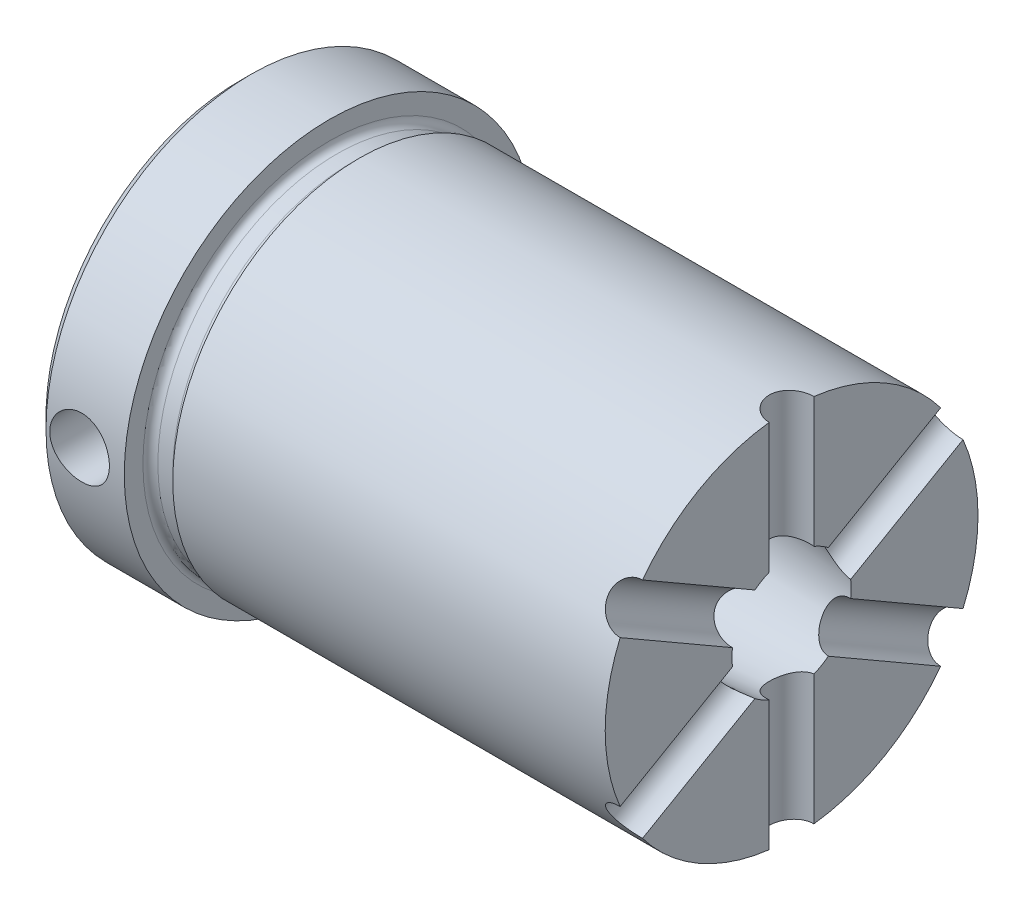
ISO-10303-21;
HEADER;
FILE_DESCRIPTION(('STEP AP214'),'2;1');
FILE_NAME('part.step','',(''),(''),'','','');
FILE_SCHEMA(('AUTOMOTIVE_DESIGN { 1 0 10303 214 1 1 1 1 }'));
ENDSEC;
DATA;
#1=APPLICATION_CONTEXT('core data for automotive mechanical design processes');
#2=APPLICATION_PROTOCOL_DEFINITION('international standard','automotive_design',2000,#1);
#3=PRODUCT_CONTEXT('',#1,'mechanical');
#4=PRODUCT('Part','Part','',(#3));
#5=PRODUCT_RELATED_PRODUCT_CATEGORY('part','',(#4));
#6=PRODUCT_DEFINITION_FORMATION('','',#4);
#7=PRODUCT_DEFINITION_CONTEXT('part definition',#1,'design');
#8=PRODUCT_DEFINITION('design','',#6,#7);
#9=PRODUCT_DEFINITION_SHAPE('','',#8);
#10=(LENGTH_UNIT() NAMED_UNIT(*) SI_UNIT(.MILLI.,.METRE.));
#11=(NAMED_UNIT(*) PLANE_ANGLE_UNIT() SI_UNIT($,.RADIAN.));
#12=(NAMED_UNIT(*) SI_UNIT($,.STERADIAN.) SOLID_ANGLE_UNIT());
#13=UNCERTAINTY_MEASURE_WITH_UNIT(LENGTH_MEASURE(1.E-05),#10,'distance_accuracy_value','');
#14=(GEOMETRIC_REPRESENTATION_CONTEXT(3) GLOBAL_UNCERTAINTY_ASSIGNED_CONTEXT((#13)) GLOBAL_UNIT_ASSIGNED_CONTEXT((#10,
#11,#12)) REPRESENTATION_CONTEXT('',''));
#15=CARTESIAN_POINT('',(0.,0.,0.));
#16=DIRECTION('',(0.,0.,1.));
#17=DIRECTION('',(1.,0.,0.));
#18=AXIS2_PLACEMENT_3D('',#15,#16,#17);
#19=CARTESIAN_POINT('',(3.,0.,7.75000000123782));
#20=DIRECTION('',(0.,0.,1.));
#21=DIRECTION('',(1.,0.,0.));
#22=AXIS2_PLACEMENT_3D('',#19,#20,#21);
#23=CONICAL_SURFACE('',#22,1.99999999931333,1.02974425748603);
#24=CARTESIAN_POINT('',(2.9999999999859,0.,6.54827876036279));
#25=VERTEX_POINT('',#24);
#26=VERTEX_LOOP('',#25);
#27=FACE_BOUND('',#26,.T.);
#28=CARTESIAN_POINT('',(3.,0.,7.75));
#29=DIRECTION('',(0.,0.,1.));
#30=DIRECTION('',(1.,0.,0.));
#31=AXIS2_PLACEMENT_3D('',#28,#29,#30);
#32=CIRCLE('',#31,2.);
#33=CARTESIAN_POINT('',(5.,0.,7.75));
#34=VERTEX_POINT('',#33);
#35=EDGE_CURVE('E216',#34,#34,#32,.T.);
#36=ORIENTED_EDGE('',*,*,#35,.T.);
#37=EDGE_LOOP('',(#36));
#38=FACE_BOUND('',#37,.T.);
#39=ADVANCED_FACE('F17',(#27,#38),#23,.F.);
#40=CARTESIAN_POINT('',(0.,8.625,0.));
#41=DIRECTION('',(-1.,0.,0.));
#42=DIRECTION('',(0.,0.,1.));
#43=AXIS2_PLACEMENT_3D('',#40,#41,#42);
#44=PLANE('',#43);
#45=CARTESIAN_POINT('',(0.,0.,0.));
#46=DIRECTION('',(1.,0.,0.));
#47=DIRECTION('',(0.,0.,-1.));
#48=AXIS2_PLACEMENT_3D('',#45,#46,#47);
#49=CIRCLE('',#48,4.25);
#50=CARTESIAN_POINT('',(0.,0.,-4.25));
#51=VERTEX_POINT('',#50);
#52=EDGE_CURVE('E20',#51,#51,#49,.T.);
#53=ORIENTED_EDGE('',*,*,#52,.T.);
#54=EDGE_LOOP('',(#53));
#55=FACE_BOUND('',#54,.T.);
#56=CARTESIAN_POINT('',(-3.36542859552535E-10,0.,0.));
#57=DIRECTION('',(1.,0.,0.));
#58=DIRECTION('',(0.,0.,-1.));
#59=AXIS2_PLACEMENT_3D('',#56,#57,#58);
#60=CIRCLE('',#59,13.0000000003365);
#61=CARTESIAN_POINT('',(-3.36542859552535E-10,0.,-13.0000000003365));
#62=VERTEX_POINT('',#61);
#63=EDGE_CURVE('E213',#62,#62,#60,.T.);
#64=ORIENTED_EDGE('',*,*,#63,.F.);
#65=EDGE_LOOP('',(#64));
#66=FACE_BOUND('',#65,.T.);
#67=ADVANCED_FACE('F537',(#55,#66),#44,.T.);
#68=CARTESIAN_POINT('',(8.5,0.,0.));
#69=DIRECTION('',(1.,0.,0.));
#70=DIRECTION('',(0.,0.,-1.));
#71=AXIS2_PLACEMENT_3D('',#68,#69,#70);
#72=CYLINDRICAL_SURFACE('',#71,4.25);
#73=CARTESIAN_POINT('',(16.9999999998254,0.,0.));
#74=DIRECTION('',(-1.,0.,0.));
#75=DIRECTION('',(0.,1.,0.));
#76=AXIS2_PLACEMENT_3D('',#73,#74,#75);
#77=CIRCLE('',#76,4.24999999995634);
#78=CARTESIAN_POINT('',(16.9999999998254,4.24999999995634,0.));
#79=VERTEX_POINT('',#78);
#80=EDGE_CURVE('E210',#79,#79,#77,.F.);
#81=ORIENTED_EDGE('',*,*,#80,.T.);
#82=EDGE_LOOP('',(#81));
#83=FACE_BOUND('',#82,.T.);
#84=ORIENTED_EDGE('',*,*,#52,.F.);
#85=EDGE_LOOP('',(#84));
#86=FACE_BOUND('',#85,.T.);
#87=ADVANCED_FACE('F356',(#83,#86),#72,.F.);
#88=CARTESIAN_POINT('',(3.,0.,10.75));
#89=DIRECTION('',(0.,0.,1.));
#90=DIRECTION('',(1.,0.,0.));
#91=AXIS2_PLACEMENT_3D('',#88,#89,#90);
#92=CYLINDRICAL_SURFACE('',#91,2.);
#93=ORIENTED_EDGE('',*,*,#35,.F.);
#94=EDGE_LOOP('',(#93));
#95=FACE_BOUND('',#94,.T.);
#96=CARTESIAN_POINT('',(5.,0.,13.75));
#97=CARTESIAN_POINT('',(4.9999949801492,-0.111603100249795,13.7499981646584));
#98=CARTESIAN_POINT('',(4.99061935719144,-0.223350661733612,13.7486258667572));
#99=CARTESIAN_POINT('',(4.95335105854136,-0.443805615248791,13.7432802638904));
#100=CARTESIAN_POINT('',(4.92542029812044,-0.552506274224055,13.739301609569));
#101=CARTESIAN_POINT('',(4.85188846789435,-0.763525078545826,13.7291905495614));
#102=CARTESIAN_POINT('',(4.80630771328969,-0.86585040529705,13.7230606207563));
#103=CARTESIAN_POINT('',(4.6988142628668,-1.06135480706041,13.7093268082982));
#104=CARTESIAN_POINT('',(4.63690803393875,-1.1545374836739,13.7017235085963));
#105=CARTESIAN_POINT('',(4.49802221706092,-1.32985637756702,13.6858245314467));
#106=CARTESIAN_POINT('',(4.4209446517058,-1.41191460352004,13.6775245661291));
#107=CARTESIAN_POINT('',(4.25411142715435,-1.56198434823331,13.6612011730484));
#108=CARTESIAN_POINT('',(4.16435441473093,-1.62999436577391,13.653177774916));
#109=CARTESIAN_POINT('',(3.97420207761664,-1.75032756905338,13.638275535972));
#110=CARTESIAN_POINT('',(3.87375973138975,-1.80257718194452,13.6314021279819));
#111=CARTESIAN_POINT('',(3.66540933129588,-1.88943562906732,13.619635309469));
#112=CARTESIAN_POINT('',(3.55750172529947,-1.92404552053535,13.6147417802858));
#113=CARTESIAN_POINT('',(3.3380889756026,-1.97440518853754,13.607530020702));
#114=CARTESIAN_POINT('',(3.22661453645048,-1.99028613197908,13.6051938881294));
#115=CARTESIAN_POINT('',(3.00256015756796,-2.00314334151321,13.6033070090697));
#116=CARTESIAN_POINT('',(2.88998027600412,-2.00012059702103,13.6037561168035));
#117=CARTESIAN_POINT('',(2.66783609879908,-1.97536357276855,13.6073725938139));
#118=CARTESIAN_POINT('',(2.5582551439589,-1.95377523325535,13.6105187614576));
#119=CARTESIAN_POINT('',(2.34428675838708,-1.89272781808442,13.619141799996));
#120=CARTESIAN_POINT('',(2.23989951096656,-1.85326811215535,13.6246187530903));
#121=CARTESIAN_POINT('',(2.03883360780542,-1.75744379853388,13.6373100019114));
#122=CARTESIAN_POINT('',(1.94218524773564,-1.70101650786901,13.6445307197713));
#123=CARTESIAN_POINT('',(1.75968145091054,-1.57290825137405,13.659890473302));
#124=CARTESIAN_POINT('',(1.67382582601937,-1.50122755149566,13.6680294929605));
#125=CARTESIAN_POINT('',(1.51450491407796,-1.34385892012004,13.6844015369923));
#126=CARTESIAN_POINT('',(1.44116103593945,-1.25804805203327,13.692634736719));
#127=CARTESIAN_POINT('',(1.30986390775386,-1.07522456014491,13.7082017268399));
#128=CARTESIAN_POINT('',(1.25191762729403,-0.97820689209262,13.7155351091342));
#129=CARTESIAN_POINT('',(1.15306109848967,-0.775595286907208,13.7284838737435));
#130=CARTESIAN_POINT('',(1.11217387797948,-0.66998998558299,13.7340969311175));
#131=CARTESIAN_POINT('',(1.04883204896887,-0.45345322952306,13.7429457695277));
#132=CARTESIAN_POINT('',(1.02633849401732,-0.342533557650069,13.7461865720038));
#133=CARTESIAN_POINT('',(1.00889757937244,-0.192361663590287,13.7487082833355));
#134=CARTESIAN_POINT('',(1.00556358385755,-0.153971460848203,13.7491916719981));
#135=CARTESIAN_POINT('',(1.00111392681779,-0.0770599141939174,13.7498378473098));
#136=CARTESIAN_POINT('',(0.999998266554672,-0.0385385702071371,13.7500006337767));
#137=CARTESIAN_POINT('',(1.0000050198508,0.111603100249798,13.7499981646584));
#138=CARTESIAN_POINT('',(1.00938064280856,0.223350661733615,13.7486258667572));
#139=CARTESIAN_POINT('',(1.04664894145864,0.443805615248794,13.7432802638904));
#140=CARTESIAN_POINT('',(1.07457970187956,0.552506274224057,13.739301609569));
#141=CARTESIAN_POINT('',(1.14811153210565,0.763525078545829,13.7291905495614));
#142=CARTESIAN_POINT('',(1.19369228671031,0.865850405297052,13.7230606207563));
#143=CARTESIAN_POINT('',(1.3011857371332,1.06135480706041,13.7093268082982));
#144=CARTESIAN_POINT('',(1.36309196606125,1.15453748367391,13.7017235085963));
#145=CARTESIAN_POINT('',(1.50197778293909,1.32985637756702,13.6858245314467));
#146=CARTESIAN_POINT('',(1.5790553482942,1.41191460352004,13.6775245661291));
#147=CARTESIAN_POINT('',(1.74588857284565,1.56198434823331,13.6612011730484));
#148=CARTESIAN_POINT('',(1.83564558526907,1.62999436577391,13.653177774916));
#149=CARTESIAN_POINT('',(2.02579792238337,1.75032756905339,13.638275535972));
#150=CARTESIAN_POINT('',(2.12624026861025,1.80257718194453,13.6314021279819));
#151=CARTESIAN_POINT('',(2.33459066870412,1.88943562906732,13.619635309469));
#152=CARTESIAN_POINT('',(2.44249827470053,1.92404552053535,13.6147417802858));
#153=CARTESIAN_POINT('',(2.6619110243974,1.97440518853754,13.607530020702));
#154=CARTESIAN_POINT('',(2.77338546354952,1.99028613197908,13.6051938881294));
#155=CARTESIAN_POINT('',(2.99743984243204,2.00314334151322,13.6033070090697));
#156=CARTESIAN_POINT('',(3.11001972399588,2.00012059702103,13.6037561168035));
#157=CARTESIAN_POINT('',(3.33216390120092,1.97536357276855,13.6073725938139));
#158=CARTESIAN_POINT('',(3.4417448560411,1.95377523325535,13.6105187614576));
#159=CARTESIAN_POINT('',(3.65571324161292,1.89272781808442,13.619141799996));
#160=CARTESIAN_POINT('',(3.76010048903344,1.85326811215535,13.6246187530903));
#161=CARTESIAN_POINT('',(3.96116639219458,1.75744379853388,13.6373100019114));
#162=CARTESIAN_POINT('',(4.05781475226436,1.70101650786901,13.6445307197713));
#163=CARTESIAN_POINT('',(4.24031854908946,1.57290825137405,13.659890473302));
#164=CARTESIAN_POINT('',(4.32617417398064,1.50122755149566,13.6680294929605));
#165=CARTESIAN_POINT('',(4.48549508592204,1.34385892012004,13.6844015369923));
#166=CARTESIAN_POINT('',(4.55883896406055,1.25804805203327,13.692634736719));
#167=CARTESIAN_POINT('',(4.69013609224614,1.07522456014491,13.7082017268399));
#168=CARTESIAN_POINT('',(4.74808237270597,0.978206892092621,13.7155351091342));
#169=CARTESIAN_POINT('',(4.84693890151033,0.775595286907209,13.7284838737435));
#170=CARTESIAN_POINT('',(4.88782612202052,0.66998998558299,13.7340969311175));
#171=CARTESIAN_POINT('',(4.95116795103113,0.45345322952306,13.7429457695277));
#172=CARTESIAN_POINT('',(4.97366150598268,0.342533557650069,13.7461865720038));
#173=CARTESIAN_POINT('',(4.99110242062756,0.192361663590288,13.7487082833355));
#174=CARTESIAN_POINT('',(4.99443641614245,0.153971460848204,13.7491916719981));
#175=CARTESIAN_POINT('',(4.99888607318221,0.0770599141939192,13.7498378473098));
#176=CARTESIAN_POINT('',(5.00000173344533,0.0385385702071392,13.7500006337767));
#177=CARTESIAN_POINT('',(5.,0.,13.75));
#178=B_SPLINE_CURVE_WITH_KNOTS('',3,(#96,#97,#98,#99,#100,#101,#102,#103,#104,#105,#106,#107,
#108,#109,#110,#111,#112,#113,#114,#115,#116,#117,#118,#119,#120,#121,#122,#123,#124,#125,#126,
#127,#128,#129,#130,#131,#132,#133,#134,#135,#136,#137,#138,#139,#140,#141,#142,#143,#144,#145,
#146,#147,#148,#149,#150,#151,#152,#153,#154,#155,#156,#157,#158,#159,#160,#161,#162,#163,#164,
#165,#166,#167,#168,#169,#170,#171,#172,#173,#174,#175,#176,#177),.UNSPECIFIED.,.T.,.F.,(4,2,2,
2,2,2,2,2,2,2,2,2,2,2,2,2,2,2,2,2,2,2,2,2,2,2,2,2,2,2,2,2,2,2,2,2,2,2,2,2,4),(0.,
0.33466232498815,0.670013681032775,1.00498018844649,1.33981420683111,1.67688608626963,
2.01399396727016,2.35265201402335,2.69128976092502,3.02754152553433,3.36377569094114,
3.69739070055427,4.03101747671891,4.36589222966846,4.70076114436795,5.03871447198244,
5.37682051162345,5.71538149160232,6.05322373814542,6.16878862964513,6.28435358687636,
6.61901591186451,6.95436726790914,7.28933377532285,7.62416779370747,7.96123967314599,
8.29834755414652,8.63700560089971,8.97564334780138,9.31189511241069,9.6481292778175,
9.98174428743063,10.3153710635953,10.6502458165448,10.9851147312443,11.3230680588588,
11.6611740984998,11.9997350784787,12.3375773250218,12.4531422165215,12.5687071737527),.UNSPECIFIED.);
#179=CARTESIAN_POINT('',(5.,0.,13.75));
#180=VERTEX_POINT('',#179);
#181=EDGE_CURVE('E207',#180,#180,#178,.T.);
#182=ORIENTED_EDGE('',*,*,#181,.F.);
#183=EDGE_LOOP('',(#182));
#184=FACE_BOUND('',#183,.T.);
#185=ADVANCED_FACE('F335',(#95,#184),#92,.F.);
#186=CARTESIAN_POINT('',(0.750000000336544,0.,0.));
#187=DIRECTION('',(1.,0.,0.));
#188=DIRECTION('',(0.,0.,-1.));
#189=AXIS2_PLACEMENT_3D('',#186,#187,#188);
#190=CONICAL_SURFACE('',#189,13.7499999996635,0.785398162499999);
#191=ORIENTED_EDGE('',*,*,#63,.T.);
#192=EDGE_LOOP('',(#191));
#193=FACE_BOUND('',#192,.T.);
#194=CARTESIAN_POINT('',(0.75,0.,0.));
#195=DIRECTION('',(1.,0.,0.));
#196=DIRECTION('',(0.,0.,-1.));
#197=AXIS2_PLACEMENT_3D('',#194,#195,#196);
#198=CIRCLE('',#197,13.75);
#199=CARTESIAN_POINT('',(0.75,0.,-13.75));
#200=VERTEX_POINT('',#199);
#201=EDGE_CURVE('E202',#200,#200,#198,.T.);
#202=ORIENTED_EDGE('',*,*,#201,.F.);
#203=EDGE_LOOP('',(#202));
#204=FACE_BOUND('',#203,.T.);
#205=ADVANCED_FACE('F348',(#193,#204),#190,.T.);
#206=CARTESIAN_POINT('',(16.9999999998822,0.,0.));
#207=DIRECTION('',(-1.,0.,0.));
#208=DIRECTION('',(0.,0.,1.));
#209=AXIS2_PLACEMENT_3D('',#206,#207,#208);
#210=CONICAL_SURFACE('',#209,4.24999999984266,1.02974425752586);
#211=CARTESIAN_POINT('',(17.1502151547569,0.,0.));
#212=DIRECTION('',(1.,0.,0.));
#213=DIRECTION('',(0.,0.,-1.));
#214=AXIS2_PLACEMENT_3D('',#211,#212,#213);
#215=CIRCLE('',#214,4.00000000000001);
#216=CARTESIAN_POINT('',(17.1502151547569,0.,-4.00000000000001));
#217=VERTEX_POINT('',#216);
#218=EDGE_CURVE('E193',#217,#217,#215,.T.);
#219=ORIENTED_EDGE('',*,*,#218,.T.);
#220=EDGE_LOOP('',(#219));
#221=FACE_BOUND('',#220,.T.);
#222=ORIENTED_EDGE('',*,*,#80,.F.);
#223=EDGE_LOOP('',(#222));
#224=FACE_BOUND('',#223,.T.);
#225=ADVANCED_FACE('F345',(#221,#224),#210,.F.);
#226=CARTESIAN_POINT('',(3.375,0.,0.));
#227=DIRECTION('',(1.,0.,0.));
#228=DIRECTION('',(0.,0.,-1.));
#229=AXIS2_PLACEMENT_3D('',#226,#227,#228);
#230=CYLINDRICAL_SURFACE('',#229,13.75);
#231=ORIENTED_EDGE('',*,*,#201,.T.);
#232=EDGE_LOOP('',(#231));
#233=FACE_BOUND('',#232,.T.);
#234=ORIENTED_EDGE('',*,*,#181,.T.);
#235=EDGE_LOOP('',(#234));
#236=FACE_BOUND('',#235,.T.);
#237=CARTESIAN_POINT('',(6.,0.,0.));
#238=DIRECTION('',(1.,0.,0.));
#239=DIRECTION('',(0.,0.,-1.));
#240=AXIS2_PLACEMENT_3D('',#237,#238,#239);
#241=CIRCLE('',#240,13.75);
#242=CARTESIAN_POINT('',(6.,0.,-13.75));
#243=VERTEX_POINT('',#242);
#244=EDGE_CURVE('E201',#243,#243,#241,.T.);
#245=ORIENTED_EDGE('',*,*,#244,.F.);
#246=EDGE_LOOP('',(#245));
#247=FACE_BOUND('',#246,.T.);
#248=ADVANCED_FACE('F339',(#233,#236,#247),#230,.T.);
#249=CARTESIAN_POINT('',(23.0751075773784,0.,0.));
#250=DIRECTION('',(1.,0.,0.));
#251=DIRECTION('',(0.,0.,-1.));
#252=AXIS2_PLACEMENT_3D('',#249,#250,#251);
#253=CYLINDRICAL_SURFACE('',#252,4.00000000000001);
#254=CARTESIAN_POINT('',(29.,0.,0.));
#255=DIRECTION('',(1.,0.,0.));
#256=DIRECTION('',(0.,0.,-1.));
#257=AXIS2_PLACEMENT_3D('',#254,#255,#256);
#258=CIRCLE('',#257,4.00000000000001);
#259=CARTESIAN_POINT('',(29.,0.,-4.00000000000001));
#260=VERTEX_POINT('',#259);
#261=EDGE_CURVE('E325',#260,#260,#258,.F.);
#262=ORIENTED_EDGE('',*,*,#261,.F.);
#263=EDGE_LOOP('',(#262));
#264=FACE_BOUND('',#263,.T.);
#265=ORIENTED_EDGE('',*,*,#218,.F.);
#266=EDGE_LOOP('',(#265));
#267=FACE_BOUND('',#266,.T.);
#268=ADVANCED_FACE('F344',(#264,#267),#253,.F.);
#269=CARTESIAN_POINT('',(6.,13.125,0.));
#270=DIRECTION('',(1.,0.,0.));
#271=DIRECTION('',(0.,0.,-1.));
#272=AXIS2_PLACEMENT_3D('',#269,#270,#271);
#273=PLANE('',#272);
#274=CARTESIAN_POINT('',(6.,0.,0.));
#275=DIRECTION('',(1.,0.,0.));
#276=DIRECTION('',(0.,1.,0.));
#277=AXIS2_PLACEMENT_3D('',#274,#275,#276);
#278=CIRCLE('',#277,12.5);
#279=CARTESIAN_POINT('',(6.,12.5,0.));
#280=VERTEX_POINT('',#279);
#281=EDGE_CURVE('E324',#280,#280,#278,.F.);
#282=ORIENTED_EDGE('',*,*,#281,.T.);
#283=EDGE_LOOP('',(#282));
#284=FACE_BOUND('',#283,.T.);
#285=ORIENTED_EDGE('',*,*,#244,.T.);
#286=EDGE_LOOP('',(#285));
#287=FACE_BOUND('',#286,.T.);
#288=ADVANCED_FACE('F367',(#284,#287),#273,.T.);
#289=CARTESIAN_POINT('',(29.,4.34995465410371,0.));
#290=DIRECTION('',(1.,0.,0.));
#291=DIRECTION('',(0.,0.,-1.));
#292=AXIS2_PLACEMENT_3D('',#289,#290,#291);
#293=PLANE('',#292);
#294=ORIENTED_EDGE('',*,*,#261,.T.);
#295=EDGE_LOOP('',(#294));
#296=FACE_BOUND('',#295,.T.);
#297=CARTESIAN_POINT('',(28.9999999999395,0.,0.));
#298=DIRECTION('',(-1.,0.,0.));
#299=DIRECTION('',(0.,0.,1.));
#300=AXIS2_PLACEMENT_3D('',#297,#298,#299);
#301=CIRCLE('',#300,4.69990930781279);
#302=CARTESIAN_POINT('',(28.9999999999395,0.,4.69990930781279));
#303=VERTEX_POINT('',#302);
#304=EDGE_CURVE('E115',#303,#303,#301,.F.);
#305=ORIENTED_EDGE('',*,*,#304,.T.);
#306=EDGE_LOOP('',(#305));
#307=FACE_BOUND('',#306,.T.);
#308=ADVANCED_FACE('F182',(#296,#307),#293,.T.);
#309=CARTESIAN_POINT('',(6.5,0.,0.));
#310=DIRECTION('',(1.,0.,0.));
#311=DIRECTION('',(0.,0.,-1.));
#312=AXIS2_PLACEMENT_3D('',#309,#310,#311);
#313=TOROIDAL_SURFACE('',#312,12.5,0.500000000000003);
#314=ORIENTED_EDGE('',*,*,#281,.F.);
#315=EDGE_LOOP('',(#314));
#316=FACE_BOUND('',#315,.T.);
#317=CARTESIAN_POINT('',(6.5,0.,0.));
#318=DIRECTION('',(1.,0.,0.));
#319=DIRECTION('',(0.,0.,-1.));
#320=AXIS2_PLACEMENT_3D('',#317,#318,#319);
#321=CIRCLE('',#320,12.);
#322=CARTESIAN_POINT('',(6.5,0.,-12.));
#323=VERTEX_POINT('',#322);
#324=EDGE_CURVE('E114',#323,#323,#321,.T.);
#325=ORIENTED_EDGE('',*,*,#324,.F.);
#326=EDGE_LOOP('',(#325));
#327=FACE_BOUND('',#326,.T.);
#328=ADVANCED_FACE('F177',(#316,#327),#313,.F.);
#329=CARTESIAN_POINT('',(29.0000000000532,0.,0.));
#330=DIRECTION('',(-1.,0.,0.));
#331=DIRECTION('',(0.,0.,1.));
#332=AXIS2_PLACEMENT_3D('',#329,#330,#331);
#333=CONICAL_SURFACE('',#332,4.69990930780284,0.087266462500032);
#334=CARTESIAN_POINT('',(37.0000000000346,0.,0.));
#335=DIRECTION('',(-1.,0.,0.));
#336=DIRECTION('',(0.,0.,1.));
#337=AXIS2_PLACEMENT_3D('',#334,#335,#336);
#338=CIRCLE('',#337,4.00000000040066);
#339=CARTESIAN_POINT('',(37.0000000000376,3.15308772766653,2.46130814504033));
#340=VERTEX_POINT('',#339);
#341=CARTESIAN_POINT('',(37.0000000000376,3.70809924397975,1.5));
#342=VERTEX_POINT('',#341);
#343=EDGE_CURVE('E107',#340,#342,#338,.T.);
#344=ORIENTED_EDGE('',*,*,#343,.F.);
#345=CARTESIAN_POINT('',(37.0000000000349,3.15308772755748,2.46130814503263));
#346=CARTESIAN_POINT('',(36.9582710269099,3.15505546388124,2.4647137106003));
#347=CARTESIAN_POINT('',(36.9166338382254,3.15586497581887,2.46960279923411));
#348=CARTESIAN_POINT('',(36.833832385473,3.15517153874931,2.48222481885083));
#349=CARTESIAN_POINT('',(36.792667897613,3.15366973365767,2.48995634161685));
#350=CARTESIAN_POINT('',(36.6706244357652,3.14572854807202,2.51715497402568));
#351=CARTESIAN_POINT('',(36.5908131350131,3.13587102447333,2.54065925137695));
#352=CARTESIAN_POINT('',(36.4364047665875,3.10716765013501,2.59679439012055));
#353=CARTESIAN_POINT('',(36.3617998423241,3.08833569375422,2.62941111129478));
#354=CARTESIAN_POINT('',(36.2191279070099,3.0417793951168,2.7019626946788));
#355=CARTESIAN_POINT('',(36.1510677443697,3.01404586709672,2.74190509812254));
#356=CARTESIAN_POINT('',(36.0193128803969,2.94795064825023,2.82957261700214));
#357=CARTESIAN_POINT('',(35.9560816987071,2.90907724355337,2.87760984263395));
#358=CARTESIAN_POINT('',(35.8400742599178,2.82164550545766,2.97738588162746));
#359=CARTESIAN_POINT('',(35.7872983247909,2.77308687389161,3.02912480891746));
#360=CARTESIAN_POINT('',(35.6933102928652,2.66613810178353,3.13448673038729));
#361=CARTESIAN_POINT('',(35.6522186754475,2.607654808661,3.18812336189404));
#362=CARTESIAN_POINT('',(35.5839473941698,2.48215226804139,3.29425269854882));
#363=CARTESIAN_POINT('',(35.5567588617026,2.41513849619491,3.34674611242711));
#364=CARTESIAN_POINT('',(35.5190460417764,2.27954021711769,3.44433825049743));
#365=CARTESIAN_POINT('',(35.5074294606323,2.21144624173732,3.48969646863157));
#366=CARTESIAN_POINT('',(35.4977606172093,2.07137662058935,3.57558974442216));
#367=CARTESIAN_POINT('',(35.499703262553,1.99940244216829,3.61612660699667));
#368=CARTESIAN_POINT('',(35.5165149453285,1.85836358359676,3.68884178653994));
#369=CARTESIAN_POINT('',(35.5305942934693,1.78938655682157,3.72137755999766));
#370=CARTESIAN_POINT('',(35.5700401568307,1.65214487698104,3.78054162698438));
#371=CARTESIAN_POINT('',(35.5954076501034,1.58388028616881,3.80716940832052));
#372=CARTESIAN_POINT('',(35.6572650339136,1.44838217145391,3.85500524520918));
#373=CARTESIAN_POINT('',(35.6940090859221,1.38121351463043,3.87606664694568));
#374=CARTESIAN_POINT('',(35.7772600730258,1.25148837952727,3.91223164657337));
#375=CARTESIAN_POINT('',(35.8237702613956,1.18893344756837,3.9273332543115));
#376=CARTESIAN_POINT('',(35.9294693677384,1.06533187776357,3.95314938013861));
#377=CARTESIAN_POINT('',(35.9893735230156,1.00480319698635,3.96341808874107));
#378=CARTESIAN_POINT('',(36.1178631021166,0.892909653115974,3.97859885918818));
#379=CARTESIAN_POINT('',(36.1864545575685,0.841551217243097,3.98350717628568));
#380=CARTESIAN_POINT('',(36.3344686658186,0.747588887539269,3.98905976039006));
#381=CARTESIAN_POINT('',(36.4142619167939,0.705552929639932,3.98947793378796));
#382=CARTESIAN_POINT('',(36.5797550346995,0.635856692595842,3.98652106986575));
#383=CARTESIAN_POINT('',(36.6654431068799,0.608168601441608,3.98315341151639));
#384=CARTESIAN_POINT('',(36.7934521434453,0.57938024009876,3.97608849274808));
#385=CARTESIAN_POINT('',(36.8344940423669,0.571977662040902,3.97352776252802));
#386=CARTESIAN_POINT('',(36.9169931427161,0.560773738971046,3.96783357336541));
#387=CARTESIAN_POINT('',(36.9584499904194,0.556969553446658,3.96470056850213));
#388=CARTESIAN_POINT('',(37.0000000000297,0.55501151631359,3.96130814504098));
#389=B_SPLINE_CURVE_WITH_KNOTS('',3,(#345,#346,#347,#348,#349,#350,#351,#352,#353,#354,#355,
#356,#357,#358,#359,#360,#361,#362,#363,#364,#365,#366,#367,#368,#369,#370,#371,#372,#373,#374,
#375,#376,#377,#378,#379,#380,#381,#382,#383,#384,#385,#386,#387,#388),.UNSPECIFIED.,.F.,.F.,(4,
2,2,2,2,2,2,2,2,2,2,2,2,2,2,2,2,2,2,2,2,4),(0.,0.125652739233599,0.251243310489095,
0.501287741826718,0.750946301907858,1.00086332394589,1.26489248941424,1.52892978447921,
1.79559831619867,2.0620965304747,2.30870447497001,2.55521980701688,2.78681099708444,
3.01842225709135,3.25563513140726,3.49292715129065,3.74913943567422,4.00553059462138,
4.27477475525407,4.54349504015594,4.66870399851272,4.79381403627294),.UNSPECIFIED.);
#390=CARTESIAN_POINT('',(37.0000000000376,0.555011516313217,3.96130814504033));
#391=VERTEX_POINT('',#390);
#392=EDGE_CURVE('E130',#340,#391,#389,.T.);
#393=ORIENTED_EDGE('',*,*,#392,.T.);
#394=CARTESIAN_POINT('',(37.0000000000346,0.,0.));
#395=DIRECTION('',(-1.,0.,0.));
#396=DIRECTION('',(0.,0.,1.));
#397=AXIS2_PLACEMENT_3D('',#394,#395,#396);
#398=CIRCLE('',#397,4.00000000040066);
#399=CARTESIAN_POINT('',(37.0000000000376,-0.55501151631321,3.96130814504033));
#400=VERTEX_POINT('',#399);
#401=EDGE_CURVE('E139',#400,#391,#398,.T.);
#402=ORIENTED_EDGE('',*,*,#401,.F.);
#403=CARTESIAN_POINT('',(37.0000000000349,-0.555011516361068,3.96130814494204));
#404=CARTESIAN_POINT('',(36.9582710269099,-0.556976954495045,3.9647150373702));
#405=CARTESIAN_POINT('',(36.9166338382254,-0.560806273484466,3.96786063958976));
#406=CARTESIAN_POINT('',(36.833832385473,-0.572083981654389,3.97357111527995));
#407=CARTESIAN_POINT('',(36.792667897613,-0.579530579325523,3.97613627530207));
#408=CARTESIAN_POINT('',(36.6706244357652,-0.607055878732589,3.98285832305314));
#409=CARTESIAN_POINT('',(36.5908131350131,-0.63233994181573,3.98607359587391));
#410=CARTESIAN_POINT('',(36.4364047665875,-0.695306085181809,3.9892833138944));
#411=CARTESIAN_POINT('',(36.3617998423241,-0.73296897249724,3.98928272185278));
#412=CARTESIAN_POINT('',(36.2191279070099,-0.819078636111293,3.98523957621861));
#413=CARTESIAN_POINT('',(36.1510677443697,-0.867536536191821,3.98119283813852));
#414=CARTESIAN_POINT('',(36.0193128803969,-0.976506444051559,3.96778645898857));
#415=CARTESIAN_POINT('',(35.9560816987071,-1.03754460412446,3.9581397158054));
#416=CARTESIAN_POINT('',(35.8400742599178,-1.16766905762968,3.93230962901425));
#417=CARTESIAN_POINT('',(35.7872983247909,-1.23675559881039,3.91612608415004));
#418=CARTESIAN_POINT('',(35.6933102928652,-1.38147608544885,3.87618669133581));
#419=CARTESIAN_POINT('',(35.6522186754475,-1.45716841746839,3.85235698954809));
#420=CARTESIAN_POINT('',(35.5839473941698,-1.61183038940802,3.79673326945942));
#421=CARTESIAN_POINT('',(35.5567588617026,-1.69079790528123,3.7649443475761));
#422=CARTESIAN_POINT('',(35.5190460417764,-1.84311431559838,3.69630886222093));
#423=CARTESIAN_POINT('',(35.5074294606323,-1.91644267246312,3.66001685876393));
#424=CARTESIAN_POINT('',(35.4977606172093,-2.06086324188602,3.58165964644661));
#425=CARTESIAN_POINT('',(35.499703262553,-2.1319562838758,3.53959661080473));
#426=CARTESIAN_POINT('',(35.5165149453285,-2.26544890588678,3.45381096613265));
#427=CARTESIAN_POINT('',(35.5305942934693,-2.32811422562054,3.41034299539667));
#428=CARTESIAN_POINT('',(35.5700401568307,-2.4479726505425,3.32107024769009));
#429=CARTESIAN_POINT('',(35.5954076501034,-2.50516528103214,3.27526526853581));
#430=CARTESIAN_POINT('',(35.6572650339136,-2.61434138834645,3.18183837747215));
#431=CARTESIAN_POINT('',(35.6940090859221,-2.66616542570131,3.13419931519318));
#432=CARTESIAN_POINT('',(35.7772600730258,-2.76234780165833,3.03993655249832));
#433=CARTESIAN_POINT('',(35.8237702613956,-2.80670364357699,2.99331319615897));
#434=CARTESIAN_POINT('',(35.9294693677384,-2.89086184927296,2.89917915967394));
#435=CARTESIAN_POINT('',(35.9893735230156,-2.93001915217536,2.85189413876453));
#436=CARTESIAN_POINT('',(36.1178631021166,-2.99911285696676,2.76258187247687));
#437=CARTESIAN_POINT('',(36.1864545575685,-3.02904280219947,2.72055832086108));
#438=CARTESIAN_POINT('',(36.3344686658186,-3.08083264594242,2.64196084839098));
#439=CARTESIAN_POINT('',(36.4142619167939,-3.10221277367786,2.60576572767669));
#440=CARTESIAN_POINT('',(36.5797550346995,-3.13450017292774,2.54392858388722));
#441=CARTESIAN_POINT('',(36.6654431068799,-3.14542774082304,2.51826616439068));
#442=CARTESIAN_POINT('',(36.7934521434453,-3.15370352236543,2.48980225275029));
#443=CARTESIAN_POINT('',(36.8344940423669,-3.15518715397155,2.48211106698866));
#444=CARTESIAN_POINT('',(36.9169931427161,-3.15585780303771,2.46956109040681));
#445=CARTESIAN_POINT('',(36.9584499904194,-3.15504663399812,2.46470006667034));
#446=CARTESIAN_POINT('',(37.0000000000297,-3.1530877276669,2.46130814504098));
#447=B_SPLINE_CURVE_WITH_KNOTS('',3,(#403,#404,#405,#406,#407,#408,#409,#410,#411,#412,#413,
#414,#415,#416,#417,#418,#419,#420,#421,#422,#423,#424,#425,#426,#427,#428,#429,#430,#431,#432,
#433,#434,#435,#436,#437,#438,#439,#440,#441,#442,#443,#444,#445,#446),.UNSPECIFIED.,.F.,.F.,(4,
2,2,2,2,2,2,2,2,2,2,2,2,2,2,2,2,2,2,2,2,4),(0.,0.125652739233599,0.251243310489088,
0.501287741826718,0.750946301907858,1.00086332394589,1.26489248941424,1.52892978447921,
1.79559831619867,2.0620965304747,2.30870447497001,2.55521980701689,2.78681099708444,
3.01842225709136,3.25563513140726,3.49292715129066,3.74913943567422,4.00553059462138,
4.27477475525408,4.54349504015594,4.66870399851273,4.79381403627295),.UNSPECIFIED.);
#448=CARTESIAN_POINT('',(37.0000000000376,-3.15308772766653,2.46130814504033));
#449=VERTEX_POINT('',#448);
#450=EDGE_CURVE('E143',#400,#449,#447,.T.);
#451=ORIENTED_EDGE('',*,*,#450,.T.);
#452=CARTESIAN_POINT('',(37.0000000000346,0.,0.));
#453=DIRECTION('',(-1.,0.,0.));
#454=DIRECTION('',(0.,0.,1.));
#455=AXIS2_PLACEMENT_3D('',#452,#453,#454);
#456=CIRCLE('',#455,4.00000000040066);
#457=CARTESIAN_POINT('',(37.0000000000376,-3.70809924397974,1.5));
#458=VERTEX_POINT('',#457);
#459=EDGE_CURVE('E146',#458,#449,#456,.T.);
#460=ORIENTED_EDGE('',*,*,#459,.F.);
#461=CARTESIAN_POINT('',(37.0000000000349,-3.70809924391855,1.49999999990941));
#462=CARTESIAN_POINT('',(36.9582710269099,-3.71203241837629,1.5000013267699));
#463=CARTESIAN_POINT('',(36.9166338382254,-3.71667124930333,1.49825784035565));
#464=CARTESIAN_POINT('',(36.833832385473,-3.7272555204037,1.49134629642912));
#465=CARTESIAN_POINT('',(36.792667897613,-3.73320031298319,1.48617993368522));
#466=CARTESIAN_POINT('',(36.6706244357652,-3.75278442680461,1.46570334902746));
#467=CARTESIAN_POINT('',(36.5908131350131,-3.76821096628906,1.44541434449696));
#468=CARTESIAN_POINT('',(36.4364047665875,-3.80247373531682,1.39248892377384));
#469=CARTESIAN_POINT('',(36.3617998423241,-3.82130466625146,1.359871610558));
#470=CARTESIAN_POINT('',(36.2191279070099,-3.86085803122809,1.28327688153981));
#471=CARTESIAN_POINT('',(36.1510677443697,-3.88158240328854,1.23928774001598));
#472=CARTESIAN_POINT('',(36.0193128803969,-3.92445709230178,1.13821384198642));
#473=CARTESIAN_POINT('',(35.9560816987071,-3.94662184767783,1.08052987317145));
#474=CARTESIAN_POINT('',(35.8400742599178,-3.98931456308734,0.95492374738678));
#475=CARTESIAN_POINT('',(35.7872983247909,-4.00984247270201,0.887001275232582));
#476=CARTESIAN_POINT('',(35.6933102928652,-4.04761418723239,0.741699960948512));
#477=CARTESIAN_POINT('',(35.6522186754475,-4.06482322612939,0.664233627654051));
#478=CARTESIAN_POINT('',(35.5839473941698,-4.09398265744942,0.502480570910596));
#479=CARTESIAN_POINT('',(35.5567588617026,-4.10593640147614,0.418198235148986));
#480=CARTESIAN_POINT('',(35.5190460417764,-4.12265453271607,0.251970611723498));
#481=CARTESIAN_POINT('',(35.5074294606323,-4.12788891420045,0.170320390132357));
#482=CARTESIAN_POINT('',(35.4977606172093,-4.13223986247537,0.00606990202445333));
#483=CARTESIAN_POINT('',(35.499703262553,-4.13135872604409,-0.0765299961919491));
#484=CARTESIAN_POINT('',(35.5165149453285,-4.12381248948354,-0.23503082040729));
#485=CARTESIAN_POINT('',(35.5305942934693,-4.11750078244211,-0.311034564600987));
#486=CARTESIAN_POINT('',(35.5700401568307,-4.10011752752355,-0.45947137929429));
#487=CARTESIAN_POINT('',(35.5954076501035,-4.08904556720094,-0.531904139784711));
#488=CARTESIAN_POINT('',(35.6572650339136,-4.06272355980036,-0.673166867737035));
#489=CARTESIAN_POINT('',(35.6940090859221,-4.04737894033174,-0.741867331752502));
#490=CARTESIAN_POINT('',(35.7772600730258,-4.0138361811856,-0.872295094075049));
#491=CARTESIAN_POINT('',(35.8237702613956,-3.99563709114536,-0.934020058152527));
#492=CARTESIAN_POINT('',(35.9294693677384,-3.95619372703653,-1.05397022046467));
#493=CARTESIAN_POINT('',(35.9893735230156,-3.93482234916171,-1.11152394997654));
#494=CARTESIAN_POINT('',(36.1178631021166,-3.89202251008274,-1.21601698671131));
#495=CARTESIAN_POINT('',(36.1864545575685,-3.87059401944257,-1.26294885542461));
#496=CARTESIAN_POINT('',(36.3344686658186,-3.82842153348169,-1.34709891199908));
#497=CARTESIAN_POINT('',(36.4142619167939,-3.80776570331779,-1.38371220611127));
#498=CARTESIAN_POINT('',(36.5797550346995,-3.77035686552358,-1.44259248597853));
#499=CARTESIAN_POINT('',(36.6654431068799,-3.75359634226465,-1.46488724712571));
#500=CARTESIAN_POINT('',(36.7934521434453,-3.73308376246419,-1.48628623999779));
#501=CARTESIAN_POINT('',(36.8344940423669,-3.72716481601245,-1.49141669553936));
#502=CARTESIAN_POINT('',(36.9169931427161,-3.71663154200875,-1.4982724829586));
#503=CARTESIAN_POINT('',(36.9584499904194,-3.71201618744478,-1.50000050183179));
#504=CARTESIAN_POINT('',(37.0000000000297,-3.70809924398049,-1.5));
#505=B_SPLINE_CURVE_WITH_KNOTS('',3,(#461,#462,#463,#464,#465,#466,#467,#468,#469,#470,#471,
#472,#473,#474,#475,#476,#477,#478,#479,#480,#481,#482,#483,#484,#485,#486,#487,#488,#489,#490,
#491,#492,#493,#494,#495,#496,#497,#498,#499,#500,#501,#502,#503,#504),.UNSPECIFIED.,.F.,.F.,(4,
2,2,2,2,2,2,2,2,2,2,2,2,2,2,2,2,2,2,2,2,4),(0.,0.125652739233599,0.251243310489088,
0.501287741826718,0.750946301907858,1.00086332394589,1.26489248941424,1.52892978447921,
1.79559831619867,2.0620965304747,2.30870447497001,2.55521980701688,2.78681099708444,
3.01842225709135,3.25563513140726,3.49292715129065,3.74913943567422,4.00553059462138,
4.27477475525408,4.54349504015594,4.66870399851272,4.79381403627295),.UNSPECIFIED.);
#506=CARTESIAN_POINT('',(37.0000000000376,-3.70809924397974,-1.5));
#507=VERTEX_POINT('',#506);
#508=EDGE_CURVE('E150',#458,#507,#505,.T.);
#509=ORIENTED_EDGE('',*,*,#508,.T.);
#510=CARTESIAN_POINT('',(37.0000000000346,0.,0.));
#511=DIRECTION('',(-1.,0.,0.));
#512=DIRECTION('',(0.,0.,1.));
#513=AXIS2_PLACEMENT_3D('',#510,#511,#512);
#514=CIRCLE('',#513,4.00000000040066);
#515=CARTESIAN_POINT('',(37.0000000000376,-3.15308772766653,-2.46130814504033));
#516=VERTEX_POINT('',#515);
#517=EDGE_CURVE('E153',#516,#507,#514,.T.);
#518=ORIENTED_EDGE('',*,*,#517,.F.);
#519=CARTESIAN_POINT('',(37.0000000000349,-3.15308772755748,-2.46130814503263));
#520=CARTESIAN_POINT('',(36.9582710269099,-3.15505546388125,-2.4647137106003));
#521=CARTESIAN_POINT('',(36.9166338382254,-3.15586497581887,-2.46960279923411));
#522=CARTESIAN_POINT('',(36.833832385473,-3.15517153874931,-2.48222481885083));
#523=CARTESIAN_POINT('',(36.792667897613,-3.15366973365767,-2.48995634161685));
#524=CARTESIAN_POINT('',(36.6706244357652,-3.14572854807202,-2.51715497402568));
#525=CARTESIAN_POINT('',(36.5908131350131,-3.13587102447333,-2.54065925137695));
#526=CARTESIAN_POINT('',(36.4364047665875,-3.10716765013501,-2.59679439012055));
#527=CARTESIAN_POINT('',(36.3617998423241,-3.08833569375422,-2.62941111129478));
#528=CARTESIAN_POINT('',(36.2191279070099,-3.0417793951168,-2.70196269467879));
#529=CARTESIAN_POINT('',(36.1510677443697,-3.01404586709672,-2.74190509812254));
#530=CARTESIAN_POINT('',(36.0193128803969,-2.94795064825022,-2.82957261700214));
#531=CARTESIAN_POINT('',(35.9560816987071,-2.90907724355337,-2.87760984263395));
#532=CARTESIAN_POINT('',(35.8400742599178,-2.82164550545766,-2.97738588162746));
#533=CARTESIAN_POINT('',(35.7872983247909,-2.77308687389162,-3.02912480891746));
#534=CARTESIAN_POINT('',(35.6933102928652,-2.66613810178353,-3.13448673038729));
#535=CARTESIAN_POINT('',(35.6522186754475,-2.607654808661,-3.18812336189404));
#536=CARTESIAN_POINT('',(35.5839473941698,-2.48215226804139,-3.29425269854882));
#537=CARTESIAN_POINT('',(35.5567588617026,-2.41513849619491,-3.34674611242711));
#538=CARTESIAN_POINT('',(35.5190460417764,-2.27954021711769,-3.44433825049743));
#539=CARTESIAN_POINT('',(35.5074294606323,-2.21144624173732,-3.48969646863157));
#540=CARTESIAN_POINT('',(35.4977606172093,-2.07137662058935,-3.57558974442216));
#541=CARTESIAN_POINT('',(35.499703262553,-1.99940244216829,-3.61612660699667));
#542=CARTESIAN_POINT('',(35.5165149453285,-1.85836358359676,-3.68884178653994));
#543=CARTESIAN_POINT('',(35.5305942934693,-1.78938655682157,-3.72137755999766));
#544=CARTESIAN_POINT('',(35.5700401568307,-1.65214487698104,-3.78054162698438));
#545=CARTESIAN_POINT('',(35.5954076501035,-1.58388028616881,-3.80716940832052));
#546=CARTESIAN_POINT('',(35.6572650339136,-1.44838217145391,-3.85500524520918));
#547=CARTESIAN_POINT('',(35.6940090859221,-1.38121351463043,-3.87606664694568));
#548=CARTESIAN_POINT('',(35.7772600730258,-1.25148837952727,-3.91223164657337));
#549=CARTESIAN_POINT('',(35.8237702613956,-1.18893344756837,-3.9273332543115));
#550=CARTESIAN_POINT('',(35.9294693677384,-1.06533187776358,-3.95314938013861));
#551=CARTESIAN_POINT('',(35.9893735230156,-1.00480319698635,-3.96341808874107));
#552=CARTESIAN_POINT('',(36.1178631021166,-0.892909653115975,-3.97859885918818));
#553=CARTESIAN_POINT('',(36.1864545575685,-0.841551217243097,-3.98350717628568));
#554=CARTESIAN_POINT('',(36.3344686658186,-0.747588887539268,-3.98905976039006));
#555=CARTESIAN_POINT('',(36.4142619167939,-0.70555292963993,-3.98947793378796));
#556=CARTESIAN_POINT('',(36.5797550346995,-0.635856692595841,-3.98652106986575));
#557=CARTESIAN_POINT('',(36.6654431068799,-0.608168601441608,-3.98315341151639));
#558=CARTESIAN_POINT('',(36.7934521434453,-0.579380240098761,-3.97608849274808));
#559=CARTESIAN_POINT('',(36.8344940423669,-0.571977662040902,-3.97352776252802));
#560=CARTESIAN_POINT('',(36.9169931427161,-0.560773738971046,-3.96783357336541));
#561=CARTESIAN_POINT('',(36.9584499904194,-0.556969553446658,-3.96470056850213));
#562=CARTESIAN_POINT('',(37.0000000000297,-0.55501151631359,-3.96130814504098));
#563=B_SPLINE_CURVE_WITH_KNOTS('',3,(#519,#520,#521,#522,#523,#524,#525,#526,#527,#528,#529,
#530,#531,#532,#533,#534,#535,#536,#537,#538,#539,#540,#541,#542,#543,#544,#545,#546,#547,#548,
#549,#550,#551,#552,#553,#554,#555,#556,#557,#558,#559,#560,#561,#562),.UNSPECIFIED.,.F.,.F.,(4,
2,2,2,2,2,2,2,2,2,2,2,2,2,2,2,2,2,2,2,2,4),(0.,0.125652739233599,0.251243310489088,
0.501287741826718,0.750946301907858,1.00086332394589,1.26489248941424,1.52892978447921,
1.79559831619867,2.0620965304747,2.30870447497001,2.55521980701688,2.78681099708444,
3.01842225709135,3.25563513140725,3.49292715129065,3.74913943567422,4.00553059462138,
4.27477475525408,4.54349504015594,4.66870399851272,4.79381403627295),.UNSPECIFIED.);
#564=CARTESIAN_POINT('',(37.0000000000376,-0.555011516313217,-3.96130814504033));
#565=VERTEX_POINT('',#564);
#566=EDGE_CURVE('E157',#516,#565,#563,.T.);
#567=ORIENTED_EDGE('',*,*,#566,.T.);
#568=CARTESIAN_POINT('',(37.0000000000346,0.,0.));
#569=DIRECTION('',(-1.,0.,0.));
#570=DIRECTION('',(0.,0.,1.));
#571=AXIS2_PLACEMENT_3D('',#568,#569,#570);
#572=CIRCLE('',#571,4.00000000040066);
#573=CARTESIAN_POINT('',(37.0000000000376,0.555011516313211,-3.96130814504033));
#574=VERTEX_POINT('',#573);
#575=EDGE_CURVE('E160',#574,#565,#572,.T.);
#576=ORIENTED_EDGE('',*,*,#575,.F.);
#577=CARTESIAN_POINT('',(37.0000000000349,0.55501151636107,-3.96130814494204));
#578=CARTESIAN_POINT('',(36.9582710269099,0.556976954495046,-3.9647150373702));
#579=CARTESIAN_POINT('',(36.9166338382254,0.560806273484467,-3.96786063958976));
#580=CARTESIAN_POINT('',(36.833832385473,0.572083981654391,-3.97357111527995));
#581=CARTESIAN_POINT('',(36.792667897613,0.579530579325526,-3.97613627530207));
#582=CARTESIAN_POINT('',(36.6706244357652,0.607055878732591,-3.98285832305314));
#583=CARTESIAN_POINT('',(36.5908131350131,0.632339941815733,-3.98607359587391));
#584=CARTESIAN_POINT('',(36.4364047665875,0.695306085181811,-3.9892833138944));
#585=CARTESIAN_POINT('',(36.3617998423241,0.732968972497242,-3.98928272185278));
#586=CARTESIAN_POINT('',(36.2191279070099,0.819078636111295,-3.98523957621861));
#587=CARTESIAN_POINT('',(36.1510677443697,0.867536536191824,-3.98119283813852));
#588=CARTESIAN_POINT('',(36.0193128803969,0.976506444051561,-3.96778645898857));
#589=CARTESIAN_POINT('',(35.9560816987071,1.03754460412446,-3.9581397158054));
#590=CARTESIAN_POINT('',(35.8400742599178,1.16766905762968,-3.93230962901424));
#591=CARTESIAN_POINT('',(35.7872983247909,1.23675559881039,-3.91612608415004));
#592=CARTESIAN_POINT('',(35.6933102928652,1.38147608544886,-3.87618669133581));
#593=CARTESIAN_POINT('',(35.6522186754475,1.45716841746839,-3.85235698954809));
#594=CARTESIAN_POINT('',(35.5839473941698,1.61183038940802,-3.79673326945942));
#595=CARTESIAN_POINT('',(35.5567588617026,1.69079790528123,-3.7649443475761));
#596=CARTESIAN_POINT('',(35.5190460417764,1.84311431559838,-3.69630886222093));
#597=CARTESIAN_POINT('',(35.5074294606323,1.91644267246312,-3.66001685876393));
#598=CARTESIAN_POINT('',(35.4977606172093,2.06086324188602,-3.58165964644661));
#599=CARTESIAN_POINT('',(35.499703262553,2.1319562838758,-3.53959661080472));
#600=CARTESIAN_POINT('',(35.5165149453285,2.26544890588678,-3.45381096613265));
#601=CARTESIAN_POINT('',(35.5305942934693,2.32811422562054,-3.41034299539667));
#602=CARTESIAN_POINT('',(35.5700401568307,2.4479726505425,-3.32107024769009));
#603=CARTESIAN_POINT('',(35.5954076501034,2.50516528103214,-3.27526526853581));
#604=CARTESIAN_POINT('',(35.6572650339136,2.61434138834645,-3.18183837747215));
#605=CARTESIAN_POINT('',(35.6940090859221,2.66616542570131,-3.13419931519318));
#606=CARTESIAN_POINT('',(35.7772600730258,2.76234780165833,-3.03993655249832));
#607=CARTESIAN_POINT('',(35.8237702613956,2.80670364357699,-2.99331319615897));
#608=CARTESIAN_POINT('',(35.9294693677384,2.89086184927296,-2.89917915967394));
#609=CARTESIAN_POINT('',(35.9893735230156,2.93001915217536,-2.85189413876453));
#610=CARTESIAN_POINT('',(36.1178631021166,2.99911285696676,-2.76258187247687));
#611=CARTESIAN_POINT('',(36.1864545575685,3.02904280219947,-2.72055832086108));
#612=CARTESIAN_POINT('',(36.3344686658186,3.08083264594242,-2.64196084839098));
#613=CARTESIAN_POINT('',(36.4142619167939,3.10221277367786,-2.60576572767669));
#614=CARTESIAN_POINT('',(36.5797550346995,3.13450017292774,-2.54392858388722));
#615=CARTESIAN_POINT('',(36.6654431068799,3.14542774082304,-2.51826616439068));
#616=CARTESIAN_POINT('',(36.7934521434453,3.15370352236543,-2.48980225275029));
#617=CARTESIAN_POINT('',(36.8344940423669,3.15518715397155,-2.48211106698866));
#618=CARTESIAN_POINT('',(36.9169931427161,3.15585780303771,-2.46956109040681));
#619=CARTESIAN_POINT('',(36.9584499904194,3.15504663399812,-2.46470006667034));
#620=CARTESIAN_POINT('',(37.0000000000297,3.1530877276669,-2.46130814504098));
#621=B_SPLINE_CURVE_WITH_KNOTS('',3,(#577,#578,#579,#580,#581,#582,#583,#584,#585,#586,#587,
#588,#589,#590,#591,#592,#593,#594,#595,#596,#597,#598,#599,#600,#601,#602,#603,#604,#605,#606,
#607,#608,#609,#610,#611,#612,#613,#614,#615,#616,#617,#618,#619,#620),.UNSPECIFIED.,.F.,.F.,(4,
2,2,2,2,2,2,2,2,2,2,2,2,2,2,2,2,2,2,2,2,4),(0.,0.125652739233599,0.251243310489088,
0.501287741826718,0.750946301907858,1.00086332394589,1.26489248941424,1.52892978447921,
1.79559831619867,2.0620965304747,2.30870447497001,2.55521980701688,2.78681099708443,
3.01842225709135,3.25563513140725,3.49292715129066,3.74913943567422,4.00553059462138,
4.27477475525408,4.54349504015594,4.66870399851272,4.79381403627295),.UNSPECIFIED.);
#622=CARTESIAN_POINT('',(37.0000000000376,3.15308772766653,-2.46130814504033));
#623=VERTEX_POINT('',#622);
#624=EDGE_CURVE('E164',#574,#623,#621,.T.);
#625=ORIENTED_EDGE('',*,*,#624,.T.);
#626=CARTESIAN_POINT('',(37.0000000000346,0.,0.));
#627=DIRECTION('',(-1.,0.,0.));
#628=DIRECTION('',(0.,0.,1.));
#629=AXIS2_PLACEMENT_3D('',#626,#627,#628);
#630=CIRCLE('',#629,4.00000000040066);
#631=CARTESIAN_POINT('',(37.0000000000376,3.70809924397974,-1.50000000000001));
#632=VERTEX_POINT('',#631);
#633=EDGE_CURVE('E122',#632,#623,#630,.T.);
#634=ORIENTED_EDGE('',*,*,#633,.F.);
#635=CARTESIAN_POINT('',(37.0000000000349,3.70809924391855,-1.49999999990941));
#636=CARTESIAN_POINT('',(36.9582710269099,3.71203241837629,-1.50000132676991));
#637=CARTESIAN_POINT('',(36.9166338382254,3.71667124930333,-1.49825784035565));
#638=CARTESIAN_POINT('',(36.833832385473,3.72725552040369,-1.49134629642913));
#639=CARTESIAN_POINT('',(36.792667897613,3.73320031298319,-1.48617993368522));
#640=CARTESIAN_POINT('',(36.6706244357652,3.7527844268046,-1.46570334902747));
#641=CARTESIAN_POINT('',(36.5908131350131,3.76821096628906,-1.44541434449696));
#642=CARTESIAN_POINT('',(36.4364047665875,3.80247373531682,-1.39248892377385));
#643=CARTESIAN_POINT('',(36.3617998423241,3.82130466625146,-1.359871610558));
#644=CARTESIAN_POINT('',(36.2191279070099,3.86085803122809,-1.28327688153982));
#645=CARTESIAN_POINT('',(36.1510677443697,3.88158240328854,-1.23928774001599));
#646=CARTESIAN_POINT('',(36.0193128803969,3.92445709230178,-1.13821384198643));
#647=CARTESIAN_POINT('',(35.9560816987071,3.94662184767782,-1.08052987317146));
#648=CARTESIAN_POINT('',(35.8400742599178,3.98931456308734,-0.954923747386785));
#649=CARTESIAN_POINT('',(35.7872983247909,4.00984247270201,-0.887001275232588));
#650=CARTESIAN_POINT('',(35.6933102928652,4.04761418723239,-0.741699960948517));
#651=CARTESIAN_POINT('',(35.6522186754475,4.06482322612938,-0.664233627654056));
#652=CARTESIAN_POINT('',(35.5839473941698,4.09398265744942,-0.502480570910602));
#653=CARTESIAN_POINT('',(35.5567588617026,4.10593640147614,-0.418198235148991));
#654=CARTESIAN_POINT('',(35.5190460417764,4.12265453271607,-0.251970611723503));
#655=CARTESIAN_POINT('',(35.5074294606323,4.12788891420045,-0.170320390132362));
#656=CARTESIAN_POINT('',(35.4977606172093,4.13223986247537,-0.00606990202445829));
#657=CARTESIAN_POINT('',(35.499703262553,4.13135872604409,0.076529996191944));
#658=CARTESIAN_POINT('',(35.5165149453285,4.12381248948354,0.235030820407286));
#659=CARTESIAN_POINT('',(35.5305942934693,4.11750078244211,0.311034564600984));
#660=CARTESIAN_POINT('',(35.5700401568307,4.10011752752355,0.459471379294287));
#661=CARTESIAN_POINT('',(35.5954076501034,4.08904556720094,0.531904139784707));
#662=CARTESIAN_POINT('',(35.6572650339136,4.06272355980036,0.673166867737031));
#663=CARTESIAN_POINT('',(35.6940090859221,4.04737894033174,0.7418673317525));
#664=CARTESIAN_POINT('',(35.7772600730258,4.0138361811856,0.872295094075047));
#665=CARTESIAN_POINT('',(35.8237702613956,3.99563709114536,0.934020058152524));
#666=CARTESIAN_POINT('',(35.9294693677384,3.95619372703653,1.05397022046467));
#667=CARTESIAN_POINT('',(35.9893735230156,3.93482234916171,1.11152394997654));
#668=CARTESIAN_POINT('',(36.1178631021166,3.89202251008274,1.2160169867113));
#669=CARTESIAN_POINT('',(36.1864545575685,3.87059401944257,1.2629488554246));
#670=CARTESIAN_POINT('',(36.3344686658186,3.82842153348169,1.34709891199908));
#671=CARTESIAN_POINT('',(36.4142619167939,3.80776570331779,1.38371220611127));
#672=CARTESIAN_POINT('',(36.5797550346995,3.77035686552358,1.44259248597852));
#673=CARTESIAN_POINT('',(36.6654431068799,3.75359634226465,1.46488724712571));
#674=CARTESIAN_POINT('',(36.7934521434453,3.73308376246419,1.48628623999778));
#675=CARTESIAN_POINT('',(36.8344940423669,3.72716481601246,1.49141669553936));
#676=CARTESIAN_POINT('',(36.9169931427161,3.71663154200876,1.4982724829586));
#677=CARTESIAN_POINT('',(36.9584499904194,3.71201618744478,1.50000050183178));
#678=CARTESIAN_POINT('',(37.0000000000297,3.70809924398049,1.5));
#679=B_SPLINE_CURVE_WITH_KNOTS('',3,(#635,#636,#637,#638,#639,#640,#641,#642,#643,#644,#645,
#646,#647,#648,#649,#650,#651,#652,#653,#654,#655,#656,#657,#658,#659,#660,#661,#662,#663,#664,
#665,#666,#667,#668,#669,#670,#671,#672,#673,#674,#675,#676,#677,#678),.UNSPECIFIED.,.F.,.F.,(4,
2,2,2,2,2,2,2,2,2,2,2,2,2,2,2,2,2,2,2,2,4),(0.,0.125652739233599,0.251243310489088,
0.501287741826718,0.750946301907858,1.00086332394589,1.26489248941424,1.52892978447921,
1.79559831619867,2.0620965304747,2.30870447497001,2.55521980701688,2.78681099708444,
3.01842225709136,3.25563513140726,3.49292715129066,3.74913943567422,4.00553059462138,
4.27477475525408,4.54349504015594,4.66870399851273,4.79381403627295),.UNSPECIFIED.);
#680=EDGE_CURVE('E118',#632,#342,#679,.T.);
#681=ORIENTED_EDGE('',*,*,#680,.T.);
#682=EDGE_LOOP('',(#344,#393,#402,#451,#460,#509,#518,#567,#576,#625,#634,#681));
#683=FACE_BOUND('',#682,.T.);
#684=ORIENTED_EDGE('',*,*,#304,.F.);
#685=EDGE_LOOP('',(#684));
#686=FACE_BOUND('',#685,.T.);
#687=ADVANCED_FACE('F119',(#683,#686),#333,.F.);
#688=CARTESIAN_POINT('',(7.,0.,0.));
#689=DIRECTION('',(1.,0.,0.));
#690=DIRECTION('',(0.,0.,-1.));
#691=AXIS2_PLACEMENT_3D('',#688,#689,#690);
#692=CYLINDRICAL_SURFACE('',#691,12.);
#693=ORIENTED_EDGE('',*,*,#324,.T.);
#694=EDGE_LOOP('',(#693));
#695=FACE_BOUND('',#694,.T.);
#696=CARTESIAN_POINT('',(7.5,0.,0.));
#697=DIRECTION('',(1.,0.,0.));
#698=DIRECTION('',(0.,0.,-1.));
#699=AXIS2_PLACEMENT_3D('',#696,#697,#698);
#700=CIRCLE('',#699,12.);
#701=CARTESIAN_POINT('',(7.5,0.,-12.));
#702=VERTEX_POINT('',#701);
#703=EDGE_CURVE('E132',#702,#702,#700,.F.);
#704=ORIENTED_EDGE('',*,*,#703,.T.);
#705=EDGE_LOOP('',(#704));
#706=FACE_BOUND('',#705,.T.);
#707=ADVANCED_FACE('F313',(#695,#706),#692,.T.);
#708=CARTESIAN_POINT('',(37.,8.25,0.));
#709=DIRECTION('',(0.,1.,0.));
#710=DIRECTION('',(0.,0.,1.));
#711=AXIS2_PLACEMENT_3D('',#708,#709,#710);
#712=CYLINDRICAL_SURFACE('',#711,1.5);
#713=DIRECTION('',(0.,1.,0.));
#714=VECTOR('',#713,1.);
#715=CARTESIAN_POINT('',(37.,8.25000000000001,-1.50000000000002));
#716=LINE('',#715,#714);
#717=CARTESIAN_POINT('',(37.,12.4096736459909,-1.50000000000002));
#718=VERTEX_POINT('',#717);
#719=EDGE_CURVE('E125',#718,#632,#716,.F.);
#720=ORIENTED_EDGE('',*,*,#719,.F.);
#721=CARTESIAN_POINT('',(37.,12.4096736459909,1.49999999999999));
#722=CARTESIAN_POINT('',(36.9579606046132,12.4096724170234,1.49999990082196));
#723=CARTESIAN_POINT('',(36.915941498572,12.4098875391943,1.49823157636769));
#724=CARTESIAN_POINT('',(36.8322069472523,12.4107375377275,1.49117819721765));
#725=CARTESIAN_POINT('',(36.7904914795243,12.4113723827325,1.48589340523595));
#726=CARTESIAN_POINT('',(36.6663422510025,12.4138839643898,1.46482008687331));
#727=CARTESIAN_POINT('',(36.584744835,12.4163678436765,1.44381244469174));
#728=CARTESIAN_POINT('',(36.4262695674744,12.4226758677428,1.38848476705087));
#729=CARTESIAN_POINT('',(36.3493933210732,12.4265004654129,1.35416023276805));
#730=CARTESIAN_POINT('',(36.2024866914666,12.4350572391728,1.27318605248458));
#731=CARTESIAN_POINT('',(36.1324557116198,12.4397893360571,1.22653748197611));
#732=CARTESIAN_POINT('',(36.0008824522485,12.4496547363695,1.12198838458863));
#733=CARTESIAN_POINT('',(35.9393799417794,12.4547897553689,1.06403798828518));
#734=CARTESIAN_POINT('',(35.8269412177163,12.4648675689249,0.938629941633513));
#735=CARTESIAN_POINT('',(35.7760066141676,12.4698103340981,0.87117084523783));
#736=CARTESIAN_POINT('',(35.686015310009,12.478963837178,0.728412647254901));
#737=CARTESIAN_POINT('',(35.6469949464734,12.4831723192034,0.653090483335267));
#738=CARTESIAN_POINT('',(35.582174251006,12.4903637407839,0.496908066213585));
#739=CARTESIAN_POINT('',(35.5563726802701,12.4933467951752,0.416048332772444));
#740=CARTESIAN_POINT('',(35.5188390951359,12.4977393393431,0.251494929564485));
#741=CARTESIAN_POINT('',(35.5070399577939,12.4991563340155,0.167816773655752));
#742=CARTESIAN_POINT('',(35.497638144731,12.5002827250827,-0.000345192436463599));
#743=CARTESIAN_POINT('',(35.5000352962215,12.4999921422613,-0.0848289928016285));
#744=CARTESIAN_POINT('',(35.5189045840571,12.4977421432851,-0.251743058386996));
#745=CARTESIAN_POINT('',(35.5353041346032,12.4957913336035,-0.334181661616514));
#746=CARTESIAN_POINT('',(35.581599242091,12.4904498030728,-0.495127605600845));
#747=CARTESIAN_POINT('',(35.6114949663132,12.4870590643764,-0.573634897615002));
#748=CARTESIAN_POINT('',(35.6840121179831,12.4792038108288,-0.724717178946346));
#749=CARTESIAN_POINT('',(35.7266653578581,12.4747366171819,-0.797276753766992));
#750=CARTESIAN_POINT('',(35.8234618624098,12.4652288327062,-0.93423223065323));
#751=CARTESIAN_POINT('',(35.8776051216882,12.4601882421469,-0.998628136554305));
#752=CARTESIAN_POINT('',(35.9962430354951,12.4500610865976,-1.11784974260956));
#753=CARTESIAN_POINT('',(36.0607995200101,12.4449744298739,-1.17261391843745));
#754=CARTESIAN_POINT('',(36.1982453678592,12.4353576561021,-1.27055519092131));
#755=CARTESIAN_POINT('',(36.2711372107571,12.4308277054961,-1.31372882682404));
#756=CARTESIAN_POINT('',(36.4232475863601,12.4228366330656,-1.38726524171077));
#757=CARTESIAN_POINT('',(36.5024721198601,12.4193765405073,-1.41761569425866));
#758=CARTESIAN_POINT('',(36.6648861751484,12.4139335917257,-1.4645202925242));
#759=CARTESIAN_POINT('',(36.7480695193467,12.4119485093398,-1.48109523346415));
#760=CARTESIAN_POINT('',(36.859873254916,12.4104329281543,-1.49370632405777));
#761=CARTESIAN_POINT('',(36.8878706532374,12.4101483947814,-1.49606758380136));
#762=CARTESIAN_POINT('',(36.9439080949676,12.4097689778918,-1.49921230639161));
#763=CARTESIAN_POINT('',(36.9719479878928,12.409673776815,-1.49999841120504));
#764=CARTESIAN_POINT('',(37.,12.4096736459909,-1.50000000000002));
#765=B_SPLINE_CURVE_WITH_KNOTS('',3,(#721,#722,#723,#724,#725,#726,#727,#728,#729,#730,#731,
#732,#733,#734,#735,#736,#737,#738,#739,#740,#741,#742,#743,#744,#745,#746,#747,#748,#749,#750,
#751,#752,#753,#754,#755,#756,#757,#758,#759,#760,#761,#762,#763,#764),.UNSPECIFIED.,.F.,.F.,(4,
2,2,2,2,2,2,2,2,2,2,2,2,2,2,2,2,2,2,2,2,4),(0.,0.126040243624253,0.252071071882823,
0.503656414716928,0.755326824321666,1.00697527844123,1.25976033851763,1.51258388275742,
1.76617098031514,2.01973430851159,2.2720771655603,2.52441695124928,2.77545654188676,
3.02649924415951,3.27817324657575,3.52984713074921,3.78307444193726,4.03637727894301,
4.28992305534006,4.54308538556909,4.62734748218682,4.71146812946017),.UNSPECIFIED.);
#766=CARTESIAN_POINT('',(37.,12.4096736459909,1.50000000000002));
#767=VERTEX_POINT('',#766);
#768=EDGE_CURVE('E129',#767,#718,#765,.T.);
#769=ORIENTED_EDGE('',*,*,#768,.F.);
#770=DIRECTION('',(0.,1.,0.));
#771=VECTOR('',#770,1.);
#772=CARTESIAN_POINT('',(37.,8.25000000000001,1.50000000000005));
#773=LINE('',#772,#771);
#774=EDGE_CURVE('E112',#342,#767,#773,.T.);
#775=ORIENTED_EDGE('',*,*,#774,.F.);
#776=ORIENTED_EDGE('',*,*,#680,.F.);
#777=EDGE_LOOP('',(#720,#769,#775,#776));
#778=FACE_BOUND('',#777,.T.);
#779=ADVANCED_FACE('F127',(#778),#712,.F.);
#780=CARTESIAN_POINT('',(37.,8.25000000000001,0.));
#781=DIRECTION('',(1.,0.,0.));
#782=DIRECTION('',(0.,0.,-1.));
#783=AXIS2_PLACEMENT_3D('',#780,#781,#782);
#784=PLANE('',#783);
#785=DIRECTION('',(0.,0.499999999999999,-0.866025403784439));
#786=VECTOR('',#785,1.);
#787=CARTESIAN_POINT('',(37.,5.42403810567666,-6.39470958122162));
#788=LINE('',#787,#786);
#789=CARTESIAN_POINT('',(37.,7.50387492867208,-9.99709263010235));
#790=VERTEX_POINT('',#789);
#791=EDGE_CURVE('E165',#623,#790,#788,.T.);
#792=ORIENTED_EDGE('',*,*,#791,.T.);
#793=CARTESIAN_POINT('',(37.,0.,0.));
#794=DIRECTION('',(1.,0.,0.));
#795=DIRECTION('',(0.,0.,-1.));
#796=AXIS2_PLACEMENT_3D('',#793,#794,#795);
#797=CIRCLE('',#796,12.5);
#798=EDGE_CURVE('E393',#718,#790,#797,.F.);
#799=ORIENTED_EDGE('',*,*,#798,.F.);
#800=ORIENTED_EDGE('',*,*,#719,.T.);
#801=ORIENTED_EDGE('',*,*,#633,.T.);
#802=EDGE_LOOP('',(#792,#799,#800,#801));
#803=FACE_BOUND('',#802,.T.);
#804=ADVANCED_FACE('F305',(#803),#784,.T.);
#805=CARTESIAN_POINT('',(37.,4.125,-7.14470958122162));
#806=DIRECTION('',(0.,0.499999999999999,-0.866025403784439));
#807=DIRECTION('',(0.,0.866025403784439,0.499999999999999));
#808=AXIS2_PLACEMENT_3D('',#805,#806,#807);
#809=CYLINDRICAL_SURFACE('',#808,1.5);
#810=DIRECTION('',(0.,-0.499999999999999,0.866025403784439));
#811=VECTOR('',#810,1.);
#812=CARTESIAN_POINT('',(37.,4.90579871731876,-11.4970926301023));
#813=LINE('',#812,#811);
#814=CARTESIAN_POINT('',(37.,4.90579871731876,-11.4970926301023));
#815=VERTEX_POINT('',#814);
#816=EDGE_CURVE('E161',#815,#574,#813,.T.);
#817=ORIENTED_EDGE('',*,*,#816,.F.);
#818=CARTESIAN_POINT('',(37.,7.50387492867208,-9.99709263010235));
#819=CARTESIAN_POINT('',(36.9579606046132,7.50387422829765,-9.99709161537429));
#820=CARTESIAN_POINT('',(36.915941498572,7.50245037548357,-9.99816207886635));
#821=CARTESIAN_POINT('',(36.8322069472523,7.49676696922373,-10.0024248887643));
#822=CARTESIAN_POINT('',(36.7904914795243,7.49250762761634,-10.005617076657));
#823=CARTESIAN_POINT('',(36.6663422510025,7.47551338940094,-10.0183288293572));
#824=CARTESIAN_POINT('',(36.584744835,7.4585621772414,-10.0309837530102));
#825=CARTESIAN_POINT('',(36.4262695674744,7.41380101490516,-10.0641105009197));
#826=CARTESIAN_POINT('',(36.3493933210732,7.38598739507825,-10.0845849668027));
#827=CARTESIAN_POINT('',(36.2024866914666,7.32014008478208,-10.1324824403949));
#828=CARTESIAN_POINT('',(36.1324557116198,7.28210728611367,-10.1599048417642));
#829=CARTESIAN_POINT('',(36.0008824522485,7.19649781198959,-10.220723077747));
#830=CARTESIAN_POINT('',(35.9393799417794,7.14887880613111,-10.2541453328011));
#831=CARTESIAN_POINT('',(35.8269412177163,7.04531115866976,-10.3255769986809));
#832=CARTESIAN_POINT('',(35.7760066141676,6.98936125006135,-10.3635871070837));
#833=CARTESIAN_POINT('',(35.686015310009,6.87030577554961,-10.442893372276));
#834=CARTESIAN_POINT('',(35.6469949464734,6.80717910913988,-10.4841991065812));
#835=CARTESIAN_POINT('',(35.582174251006,6.67551687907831,-10.5685182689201));
#836=CARTESIAN_POINT('',(35.5563726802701,6.60698182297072,-10.6115315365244));
#837=CARTESIAN_POINT('',(35.5188390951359,6.46667066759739,-10.6976122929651));
#838=CARTESIAN_POINT('',(35.5070399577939,6.39491175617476,-10.7406785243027));
#839=CARTESIAN_POINT('',(35.497638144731,6.24984241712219,-10.8257349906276));
#840=CARTESIAN_POINT('',(35.5000352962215,6.17653200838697,-10.8677252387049));
#841=CARTESIAN_POINT('',(35.5189045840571,6.03085518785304,-10.9492337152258));
#842=CARTESIAN_POINT('',(35.5353041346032,5.95848585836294,-10.9887635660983));
#843=CARTESIAN_POINT('',(35.581599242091,5.81643181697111,-11.0646106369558));
#844=CARTESIAN_POINT('',(35.6114949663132,5.74674713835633,-11.1009278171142));
#845=CARTESIAN_POINT('',(35.6840121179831,5.61197841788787,-11.1696661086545));
#846=CARTESIAN_POINT('',(35.7266653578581,5.54690638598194,-11.202077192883));
#847=CARTESIAN_POINT('',(35.8234618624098,5.42354557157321,-11.2623209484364));
#848=CARTESIAN_POINT('',(35.8776051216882,5.3652567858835,-11.2901536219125));
#849=CARTESIAN_POINT('',(35.9962430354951,5.25694426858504,-11.3409940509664));
#850=CARTESIAN_POINT('',(36.0607995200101,5.2069737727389,-11.3639709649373));
#851=CARTESIAN_POINT('',(36.1982453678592,5.11734575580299,-11.4046132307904));
#852=CARTESIAN_POINT('',(36.2711372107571,5.07769131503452,-11.4222769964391));
#853=CARTESIAN_POINT('',(36.4232475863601,5.0100113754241,-11.4521247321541));
#854=CARTESIAN_POINT('',(36.5024721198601,4.98199706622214,-11.4643034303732));
#855=CARTESIAN_POINT('',(36.6648861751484,4.93865501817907,-11.4830419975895));
#856=CARTESIAN_POINT('',(36.7480695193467,4.9233081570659,-11.4896103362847));
#857=CARTESIAN_POINT('',(36.859873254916,4.91162884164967,-11.4946033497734));
#858=CARTESIAN_POINT('',(36.8878706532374,4.90944166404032,-11.4955375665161));
#859=CARTESIAN_POINT('',(36.9439080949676,4.90652854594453,-11.4967813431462));
#860=CARTESIAN_POINT('',(36.9719479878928,4.90580015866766,-11.4970919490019));
#861=CARTESIAN_POINT('',(37.,4.90579871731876,-11.4970926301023));
#862=B_SPLINE_CURVE_WITH_KNOTS('',3,(#818,#819,#820,#821,#822,#823,#824,#825,#826,#827,#828,
#829,#830,#831,#832,#833,#834,#835,#836,#837,#838,#839,#840,#841,#842,#843,#844,#845,#846,#847,
#848,#849,#850,#851,#852,#853,#854,#855,#856,#857,#858,#859,#860,#861),.UNSPECIFIED.,.F.,.F.,(4,
2,2,2,2,2,2,2,2,2,2,2,2,2,2,2,2,2,2,2,2,4),(0.,0.126040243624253,0.252071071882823,
0.503656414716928,0.755326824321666,1.00697527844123,1.25976033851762,1.51258388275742,
1.76617098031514,2.01973430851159,2.2720771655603,2.52441695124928,2.77545654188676,
3.0264992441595,3.27817324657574,3.5298471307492,3.78307444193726,4.03637727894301,
4.28992305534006,4.54308538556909,4.62734748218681,4.71146812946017),.UNSPECIFIED.);
#863=EDGE_CURVE('E246',#790,#815,#862,.T.);
#864=ORIENTED_EDGE('',*,*,#863,.F.);
#865=ORIENTED_EDGE('',*,*,#791,.F.);
#866=ORIENTED_EDGE('',*,*,#624,.F.);
#867=EDGE_LOOP('',(#817,#864,#865,#866));
#868=FACE_BOUND('',#867,.T.);
#869=ADVANCED_FACE('F301',(#868),#809,.F.);
#870=CARTESIAN_POINT('',(37.,8.25000000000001,0.));
#871=DIRECTION('',(1.,0.,0.));
#872=DIRECTION('',(0.,0.,-1.));
#873=AXIS2_PLACEMENT_3D('',#870,#871,#872);
#874=PLANE('',#873);
#875=DIRECTION('',(0.,-0.5,-0.866025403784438));
#876=VECTOR('',#875,1.);
#877=CARTESIAN_POINT('',(37.,-2.82596189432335,-7.89470958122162));
#878=LINE('',#877,#876);
#879=CARTESIAN_POINT('',(37.,-4.90579871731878,-11.4970926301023));
#880=VERTEX_POINT('',#879);
#881=EDGE_CURVE('E158',#565,#880,#878,.T.);
#882=ORIENTED_EDGE('',*,*,#881,.T.);
#883=CARTESIAN_POINT('',(37.,0.,0.));
#884=DIRECTION('',(1.,0.,0.));
#885=DIRECTION('',(0.,0.,-1.));
#886=AXIS2_PLACEMENT_3D('',#883,#884,#885);
#887=CIRCLE('',#886,12.5);
#888=EDGE_CURVE('E278',#815,#880,#887,.F.);
#889=ORIENTED_EDGE('',*,*,#888,.F.);
#890=ORIENTED_EDGE('',*,*,#816,.T.);
#891=ORIENTED_EDGE('',*,*,#575,.T.);
#892=EDGE_LOOP('',(#882,#889,#890,#891));
#893=FACE_BOUND('',#892,.T.);
#894=ADVANCED_FACE('F285',(#893),#874,.T.);
#895=CARTESIAN_POINT('',(37.,-4.125,-7.14470958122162));
#896=DIRECTION('',(0.,-0.5,-0.866025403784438));
#897=DIRECTION('',(0.,0.866025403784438,-0.5));
#898=AXIS2_PLACEMENT_3D('',#895,#896,#897);
#899=CYLINDRICAL_SURFACE('',#898,1.5);
#900=DIRECTION('',(0.,0.5,0.866025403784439));
#901=VECTOR('',#900,1.);
#902=CARTESIAN_POINT('',(37.,-7.50387492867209,-9.99709263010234));
#903=LINE('',#902,#901);
#904=CARTESIAN_POINT('',(37.,-7.50387492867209,-9.99709263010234));
#905=VERTEX_POINT('',#904);
#906=EDGE_CURVE('E154',#905,#516,#903,.T.);
#907=ORIENTED_EDGE('',*,*,#906,.F.);
#908=CARTESIAN_POINT('',(37.,-4.90579871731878,-11.4970926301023));
#909=CARTESIAN_POINT('',(36.9579606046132,-4.90579818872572,-11.4970915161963));
#910=CARTESIAN_POINT('',(36.915941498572,-4.90743716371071,-11.496393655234));
#911=CARTESIAN_POINT('',(36.8322069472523,-4.91397056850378,-11.493603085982));
#912=CARTESIAN_POINT('',(36.7904914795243,-4.91886475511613,-11.4915104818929));
#913=CARTESIAN_POINT('',(36.6663422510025,-4.93837057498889,-11.4831489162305));
#914=CARTESIAN_POINT('',(36.584744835,-4.95780566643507,-11.4747961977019));
#915=CARTESIAN_POINT('',(36.4262695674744,-5.00887485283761,-11.4525952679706));
#916=CARTESIAN_POINT('',(36.3493933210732,-5.04051307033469,-11.4387451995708));
#917=CARTESIAN_POINT('',(36.2024866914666,-5.11491715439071,-11.4056684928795));
#918=CARTESIAN_POINT('',(36.1324557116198,-5.15768204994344,-11.3864423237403));
#919=CARTESIAN_POINT('',(36.0008824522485,-5.25315692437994,-11.3427114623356));
#920=CARTESIAN_POINT('',(35.9393799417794,-5.30591094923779,-11.3181833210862));
#921=CARTESIAN_POINT('',(35.8269412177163,-5.4195564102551,-11.2642069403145));
#922=CARTESIAN_POINT('',(35.7760066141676,-5.4804490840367,-11.2347579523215));
#923=CARTESIAN_POINT('',(35.686015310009,-5.60865806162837,-11.1713060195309));
#924=CARTESIAN_POINT('',(35.6469949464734,-5.67599321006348,-11.1372895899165));
#925=CARTESIAN_POINT('',(35.582174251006,-5.81484686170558,-11.0654263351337));
#926=CARTESIAN_POINT('',(35.5563726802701,-5.88636497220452,-11.0275798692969));
#927=CARTESIAN_POINT('',(35.5188390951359,-6.03106867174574,-10.9491072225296));
#928=CARTESIAN_POINT('',(35.5070399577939,-6.1042445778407,-10.9084952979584));
#929=CARTESIAN_POINT('',(35.497638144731,-6.25044030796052,-10.8253897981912));
#930=CARTESIAN_POINT('',(35.5000352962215,-6.32346013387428,-10.7828962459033));
#931=CARTESIAN_POINT('',(35.5189045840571,-6.46688695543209,-10.6974906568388));
#932=CARTESIAN_POINT('',(35.5353041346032,-6.53730547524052,-10.6545819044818));
#933=CARTESIAN_POINT('',(35.581599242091,-6.67401798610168,-10.569483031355));
#934=CARTESIAN_POINT('',(35.6114949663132,-6.74031192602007,-10.5272929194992));
#935=CARTESIAN_POINT('',(35.6840121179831,-6.86722539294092,-10.4449489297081));
#936=CARTESIAN_POINT('',(35.7266653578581,-6.92783023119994,-10.404800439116));
#937=CARTESIAN_POINT('',(35.8234618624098,-7.041683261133,-10.3280887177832));
#938=CARTESIAN_POINT('',(35.8776051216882,-7.09493145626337,-10.2915254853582));
#939=CARTESIAN_POINT('',(35.9962430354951,-7.19311681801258,-10.2231443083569));
#940=CARTESIAN_POINT('',(36.0607995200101,-7.23800065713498,-10.1913570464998));
#941=CARTESIAN_POINT('',(36.1982453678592,-7.31801190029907,-10.1340580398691));
#942=CARTESIAN_POINT('',(36.2711372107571,-7.3531363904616,-10.1085481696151));
#943=CARTESIAN_POINT('',(36.4232475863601,-7.41282525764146,-10.0648594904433));
#944=CARTESIAN_POINT('',(36.5024721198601,-7.43737947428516,-10.0466877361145));
#945=CARTESIAN_POINT('',(36.6648861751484,-7.47527857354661,-10.0185217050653));
#946=CARTESIAN_POINT('',(36.7480695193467,-7.48864035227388,-10.0085151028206));
#947=CARTESIAN_POINT('',(36.859873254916,-7.49880408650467,-10.0008970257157));
#948=CARTESIAN_POINT('',(36.8878706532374,-7.50070673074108,-9.99946998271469));
#949=CARTESIAN_POINT('',(36.9439080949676,-7.50324043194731,-9.99756903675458));
#950=CARTESIAN_POINT('',(36.9719479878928,-7.50387361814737,-9.99709353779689));
#951=CARTESIAN_POINT('',(37.,-7.50387492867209,-9.99709263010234));
#952=B_SPLINE_CURVE_WITH_KNOTS('',3,(#908,#909,#910,#911,#912,#913,#914,#915,#916,#917,#918,
#919,#920,#921,#922,#923,#924,#925,#926,#927,#928,#929,#930,#931,#932,#933,#934,#935,#936,#937,
#938,#939,#940,#941,#942,#943,#944,#945,#946,#947,#948,#949,#950,#951),.UNSPECIFIED.,.F.,.F.,(4,
2,2,2,2,2,2,2,2,2,2,2,2,2,2,2,2,2,2,2,2,4),(0.,0.126040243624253,0.252071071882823,
0.503656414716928,0.755326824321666,1.00697527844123,1.25976033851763,1.51258388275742,
1.76617098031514,2.01973430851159,2.2720771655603,2.52441695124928,2.77545654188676,
3.0264992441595,3.27817324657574,3.5298471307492,3.78307444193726,4.03637727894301,
4.28992305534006,4.54308538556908,4.62734748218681,4.71146812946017),.UNSPECIFIED.);
#953=EDGE_CURVE('E271',#880,#905,#952,.T.);
#954=ORIENTED_EDGE('',*,*,#953,.F.);
#955=ORIENTED_EDGE('',*,*,#881,.F.);
#956=ORIENTED_EDGE('',*,*,#566,.F.);
#957=EDGE_LOOP('',(#907,#954,#955,#956));
#958=FACE_BOUND('',#957,.T.);
#959=ADVANCED_FACE('F279',(#958),#899,.F.);
#960=CARTESIAN_POINT('',(37.,8.25000000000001,0.));
#961=DIRECTION('',(1.,0.,0.));
#962=DIRECTION('',(0.,0.,-1.));
#963=AXIS2_PLACEMENT_3D('',#960,#961,#962);
#964=PLANE('',#963);
#965=DIRECTION('',(0.,-1.,0.));
#966=VECTOR('',#965,1.);
#967=CARTESIAN_POINT('',(37.,-8.25,-1.5));
#968=LINE('',#967,#966);
#969=CARTESIAN_POINT('',(37.,-12.4096736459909,-1.5));
#970=VERTEX_POINT('',#969);
#971=EDGE_CURVE('E151',#507,#970,#968,.T.);
#972=ORIENTED_EDGE('',*,*,#971,.T.);
#973=CARTESIAN_POINT('',(37.,0.,0.));
#974=DIRECTION('',(1.,0.,0.));
#975=DIRECTION('',(0.,0.,-1.));
#976=AXIS2_PLACEMENT_3D('',#973,#974,#975);
#977=CIRCLE('',#976,12.5);
#978=EDGE_CURVE('E277',#905,#970,#977,.F.);
#979=ORIENTED_EDGE('',*,*,#978,.F.);
#980=ORIENTED_EDGE('',*,*,#906,.T.);
#981=ORIENTED_EDGE('',*,*,#517,.T.);
#982=EDGE_LOOP('',(#972,#979,#980,#981));
#983=FACE_BOUND('',#982,.T.);
#984=ADVANCED_FACE('F284',(#983),#964,.T.);
#985=CARTESIAN_POINT('',(37.,-8.25,0.));
#986=DIRECTION('',(0.,-1.,0.));
#987=DIRECTION('',(0.,0.,-1.));
#988=AXIS2_PLACEMENT_3D('',#985,#986,#987);
#989=CYLINDRICAL_SURFACE('',#988,1.5);
#990=DIRECTION('',(0.,1.,0.));
#991=VECTOR('',#990,1.);
#992=CARTESIAN_POINT('',(37.,8.25000000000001,1.50000000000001));
#993=LINE('',#992,#991);
#994=CARTESIAN_POINT('',(37.,-12.4096736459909,1.50000000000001));
#995=VERTEX_POINT('',#994);
#996=EDGE_CURVE('E147',#995,#458,#993,.T.);
#997=ORIENTED_EDGE('',*,*,#996,.F.);
#998=CARTESIAN_POINT('',(37.,-12.4096736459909,-1.5));
#999=CARTESIAN_POINT('',(36.9579606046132,-12.4096724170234,-1.49999990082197));
#1000=CARTESIAN_POINT('',(36.915941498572,-12.4098875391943,-1.4982315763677));
#1001=CARTESIAN_POINT('',(36.8322069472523,-12.4107375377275,-1.49117819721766));
#1002=CARTESIAN_POINT('',(36.7904914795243,-12.4113723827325,-1.48589340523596));
#1003=CARTESIAN_POINT('',(36.6663422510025,-12.4138839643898,-1.46482008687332));
#1004=CARTESIAN_POINT('',(36.584744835,-12.4163678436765,-1.44381244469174));
#1005=CARTESIAN_POINT('',(36.4262695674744,-12.4226758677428,-1.38848476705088));
#1006=CARTESIAN_POINT('',(36.3493933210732,-12.4265004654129,-1.35416023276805));
#1007=CARTESIAN_POINT('',(36.2024866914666,-12.4350572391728,-1.27318605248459));
#1008=CARTESIAN_POINT('',(36.1324557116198,-12.4397893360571,-1.22653748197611));
#1009=CARTESIAN_POINT('',(36.0008824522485,-12.4496547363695,-1.12198838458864));
#1010=CARTESIAN_POINT('',(35.9393799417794,-12.4547897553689,-1.06403798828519));
#1011=CARTESIAN_POINT('',(35.8269412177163,-12.4648675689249,-0.93862994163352));
#1012=CARTESIAN_POINT('',(35.7760066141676,-12.4698103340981,-0.871170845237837));
#1013=CARTESIAN_POINT('',(35.686015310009,-12.478963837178,-0.728412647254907));
#1014=CARTESIAN_POINT('',(35.6469949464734,-12.4831723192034,-0.653090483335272));
#1015=CARTESIAN_POINT('',(35.582174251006,-12.4903637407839,-0.496908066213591));
#1016=CARTESIAN_POINT('',(35.5563726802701,-12.4933467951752,-0.416048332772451));
#1017=CARTESIAN_POINT('',(35.5188390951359,-12.4977393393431,-0.251494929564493));
#1018=CARTESIAN_POINT('',(35.5070399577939,-12.4991563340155,-0.16781677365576));
#1019=CARTESIAN_POINT('',(35.497638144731,-12.5002827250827,0.000345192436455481));
#1020=CARTESIAN_POINT('',(35.5000352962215,-12.4999921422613,0.0848289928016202));
#1021=CARTESIAN_POINT('',(35.5189045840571,-12.4977421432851,0.251743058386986));
#1022=CARTESIAN_POINT('',(35.5353041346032,-12.4957913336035,0.334181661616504));
#1023=CARTESIAN_POINT('',(35.581599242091,-12.4904498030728,0.495127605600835));
#1024=CARTESIAN_POINT('',(35.6114949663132,-12.4870590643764,0.573634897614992));
#1025=CARTESIAN_POINT('',(35.6840121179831,-12.4792038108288,0.724717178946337));
#1026=CARTESIAN_POINT('',(35.7266653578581,-12.4747366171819,0.797276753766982));
#1027=CARTESIAN_POINT('',(35.8234618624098,-12.4652288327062,0.934232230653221));
#1028=CARTESIAN_POINT('',(35.8776051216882,-12.4601882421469,0.998628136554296));
#1029=CARTESIAN_POINT('',(35.9962430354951,-12.4500610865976,1.11784974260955));
#1030=CARTESIAN_POINT('',(36.0607995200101,-12.4449744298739,1.17261391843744));
#1031=CARTESIAN_POINT('',(36.1982453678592,-12.4353576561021,1.2705551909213));
#1032=CARTESIAN_POINT('',(36.2711372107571,-12.4308277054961,1.31372882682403));
#1033=CARTESIAN_POINT('',(36.4232475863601,-12.4228366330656,1.38726524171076));
#1034=CARTESIAN_POINT('',(36.5024721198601,-12.4193765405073,1.41761569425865));
#1035=CARTESIAN_POINT('',(36.6648861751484,-12.4139335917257,1.46452029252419));
#1036=CARTESIAN_POINT('',(36.7480695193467,-12.4119485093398,1.48109523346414));
#1037=CARTESIAN_POINT('',(36.859873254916,-12.4104329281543,1.49370632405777));
#1038=CARTESIAN_POINT('',(36.8878706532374,-12.4101483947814,1.49606758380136));
#1039=CARTESIAN_POINT('',(36.9439080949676,-12.4097689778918,1.4992123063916));
#1040=CARTESIAN_POINT('',(36.9719479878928,-12.409673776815,1.49999841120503));
#1041=CARTESIAN_POINT('',(37.,-12.4096736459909,1.50000000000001));
#1042=B_SPLINE_CURVE_WITH_KNOTS('',3,(#998,#999,#1000,#1001,#1002,#1003,#1004,#1005,#1006,#1007,
#1008,#1009,#1010,#1011,#1012,#1013,#1014,#1015,#1016,#1017,#1018,#1019,#1020,#1021,#1022,#1023,
#1024,#1025,#1026,#1027,#1028,#1029,#1030,#1031,#1032,#1033,#1034,#1035,#1036,#1037,#1038,#1039,
#1040,#1041),.UNSPECIFIED.,.F.,.F.,(4,2,2,2,2,2,2,2,2,2,2,2,2,2,2,2,2,2,2,2,2,4),(0.,
0.126040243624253,0.252071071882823,0.503656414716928,0.755326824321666,1.00697527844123,
1.25976033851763,1.51258388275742,1.76617098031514,2.01973430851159,2.2720771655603,
2.52441695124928,2.77545654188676,3.02649924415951,3.27817324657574,3.5298471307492,
3.78307444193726,4.03637727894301,4.28992305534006,4.54308538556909,4.62734748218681,
4.71146812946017),.UNSPECIFIED.);
#1043=EDGE_CURVE('E264',#970,#995,#1042,.T.);
#1044=ORIENTED_EDGE('',*,*,#1043,.F.);
#1045=ORIENTED_EDGE('',*,*,#971,.F.);
#1046=ORIENTED_EDGE('',*,*,#508,.F.);
#1047=EDGE_LOOP('',(#997,#1044,#1045,#1046));
#1048=FACE_BOUND('',#1047,.T.);
#1049=ADVANCED_FACE('F452',(#1048),#989,.F.);
#1050=CARTESIAN_POINT('',(37.,8.25000000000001,0.));
#1051=DIRECTION('',(1.,0.,0.));
#1052=DIRECTION('',(0.,0.,-1.));
#1053=AXIS2_PLACEMENT_3D('',#1050,#1051,#1052);
#1054=PLANE('',#1053);
#1055=DIRECTION('',(0.,-0.5,0.866025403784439));
#1056=VECTOR('',#1055,1.);
#1057=CARTESIAN_POINT('',(37.,-5.42403810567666,6.39470958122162));
#1058=LINE('',#1057,#1056);
#1059=CARTESIAN_POINT('',(37.,-7.50387492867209,9.99709263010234));
#1060=VERTEX_POINT('',#1059);
#1061=EDGE_CURVE('E144',#449,#1060,#1058,.T.);
#1062=ORIENTED_EDGE('',*,*,#1061,.T.);
#1063=CARTESIAN_POINT('',(37.,0.,0.));
#1064=DIRECTION('',(1.,0.,0.));
#1065=DIRECTION('',(0.,0.,-1.));
#1066=AXIS2_PLACEMENT_3D('',#1063,#1064,#1065);
#1067=CIRCLE('',#1066,12.5);
#1068=EDGE_CURVE('E416',#995,#1060,#1067,.F.);
#1069=ORIENTED_EDGE('',*,*,#1068,.F.);
#1070=ORIENTED_EDGE('',*,*,#996,.T.);
#1071=ORIENTED_EDGE('',*,*,#459,.T.);
#1072=EDGE_LOOP('',(#1062,#1069,#1070,#1071));
#1073=FACE_BOUND('',#1072,.T.);
#1074=ADVANCED_FACE('F436',(#1073),#1054,.T.);
#1075=CARTESIAN_POINT('',(37.,-4.125,7.14470958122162));
#1076=DIRECTION('',(0.,-0.5,0.866025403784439));
#1077=DIRECTION('',(0.,-0.866025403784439,-0.5));
#1078=AXIS2_PLACEMENT_3D('',#1075,#1076,#1077);
#1079=CYLINDRICAL_SURFACE('',#1078,1.5);
#1080=DIRECTION('',(0.,0.5,-0.866025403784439));
#1081=VECTOR('',#1080,1.);
#1082=CARTESIAN_POINT('',(37.,-4.90579871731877,11.4970926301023));
#1083=LINE('',#1082,#1081);
#1084=CARTESIAN_POINT('',(37.,-4.90579871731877,11.4970926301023));
#1085=VERTEX_POINT('',#1084);
#1086=EDGE_CURVE('E140',#1085,#400,#1083,.T.);
#1087=ORIENTED_EDGE('',*,*,#1086,.F.);
#1088=CARTESIAN_POINT('',(37.,-7.50387492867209,9.99709263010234));
#1089=CARTESIAN_POINT('',(36.9579606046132,-7.50387422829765,9.99709161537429));
#1090=CARTESIAN_POINT('',(36.915941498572,-7.50245037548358,9.99816207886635));
#1091=CARTESIAN_POINT('',(36.8322069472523,-7.49676696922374,10.0024248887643));
#1092=CARTESIAN_POINT('',(36.7904914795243,-7.49250762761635,10.0056170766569));
#1093=CARTESIAN_POINT('',(36.6663422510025,-7.47551338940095,10.0183288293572));
#1094=CARTESIAN_POINT('',(36.584744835,-7.4585621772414,10.0309837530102));
#1095=CARTESIAN_POINT('',(36.4262695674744,-7.41380101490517,10.0641105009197));
#1096=CARTESIAN_POINT('',(36.3493933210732,-7.38598739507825,10.0845849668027));
#1097=CARTESIAN_POINT('',(36.2024866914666,-7.32014008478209,10.1324824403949));
#1098=CARTESIAN_POINT('',(36.1324557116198,-7.28210728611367,10.1599048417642));
#1099=CARTESIAN_POINT('',(36.0008824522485,-7.19649781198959,10.220723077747));
#1100=CARTESIAN_POINT('',(35.9393799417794,-7.14887880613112,10.254145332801));
#1101=CARTESIAN_POINT('',(35.8269412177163,-7.04531115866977,10.3255769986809));
#1102=CARTESIAN_POINT('',(35.7760066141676,-6.98936125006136,10.3635871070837));
#1103=CARTESIAN_POINT('',(35.686015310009,-6.87030577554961,10.442893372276));
#1104=CARTESIAN_POINT('',(35.6469949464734,-6.80717910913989,10.4841991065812));
#1105=CARTESIAN_POINT('',(35.582174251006,-6.67551687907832,10.5685182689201));
#1106=CARTESIAN_POINT('',(35.5563726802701,-6.60698182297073,10.6115315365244));
#1107=CARTESIAN_POINT('',(35.5188390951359,-6.4666706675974,10.6976122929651));
#1108=CARTESIAN_POINT('',(35.5070399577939,-6.39491175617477,10.7406785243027));
#1109=CARTESIAN_POINT('',(35.497638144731,-6.24984241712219,10.8257349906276));
#1110=CARTESIAN_POINT('',(35.5000352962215,-6.17653200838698,10.8677252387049));
#1111=CARTESIAN_POINT('',(35.5189045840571,-6.03085518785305,10.9492337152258));
#1112=CARTESIAN_POINT('',(35.5353041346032,-5.95848585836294,10.9887635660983));
#1113=CARTESIAN_POINT('',(35.581599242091,-5.81643181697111,11.0646106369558));
#1114=CARTESIAN_POINT('',(35.6114949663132,-5.74674713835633,11.1009278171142));
#1115=CARTESIAN_POINT('',(35.6840121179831,-5.61197841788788,11.1696661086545));
#1116=CARTESIAN_POINT('',(35.7266653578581,-5.54690638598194,11.2020771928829));
#1117=CARTESIAN_POINT('',(35.8234618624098,-5.42354557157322,11.2623209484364));
#1118=CARTESIAN_POINT('',(35.8776051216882,-5.3652567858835,11.2901536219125));
#1119=CARTESIAN_POINT('',(35.9962430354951,-5.25694426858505,11.3409940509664));
#1120=CARTESIAN_POINT('',(36.0607995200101,-5.2069737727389,11.3639709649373));
#1121=CARTESIAN_POINT('',(36.1982453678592,-5.117345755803,11.4046132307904));
#1122=CARTESIAN_POINT('',(36.2711372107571,-5.07769131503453,11.4222769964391));
#1123=CARTESIAN_POINT('',(36.4232475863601,-5.01001137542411,11.4521247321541));
#1124=CARTESIAN_POINT('',(36.5024721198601,-4.98199706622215,11.4643034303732));
#1125=CARTESIAN_POINT('',(36.6648861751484,-4.93865501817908,11.4830419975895));
#1126=CARTESIAN_POINT('',(36.7480695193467,-4.9233081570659,11.4896103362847));
#1127=CARTESIAN_POINT('',(36.859873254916,-4.91162884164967,11.4946033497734));
#1128=CARTESIAN_POINT('',(36.8878706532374,-4.90944166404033,11.495537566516));
#1129=CARTESIAN_POINT('',(36.9439080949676,-4.90652854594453,11.4967813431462));
#1130=CARTESIAN_POINT('',(36.9719479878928,-4.90580015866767,11.4970919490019));
#1131=CARTESIAN_POINT('',(37.,-4.90579871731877,11.4970926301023));
#1132=B_SPLINE_CURVE_WITH_KNOTS('',3,(#1088,#1089,#1090,#1091,#1092,#1093,#1094,#1095,#1096,
#1097,#1098,#1099,#1100,#1101,#1102,#1103,#1104,#1105,#1106,#1107,#1108,#1109,#1110,#1111,#1112,
#1113,#1114,#1115,#1116,#1117,#1118,#1119,#1120,#1121,#1122,#1123,#1124,#1125,#1126,#1127,#1128,
#1129,#1130,#1131),.UNSPECIFIED.,.F.,.F.,(4,2,2,2,2,2,2,2,2,2,2,2,2,2,2,2,2,2,2,2,2,4),(0.,
0.126040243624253,0.252071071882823,0.503656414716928,0.755326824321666,1.00697527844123,
1.25976033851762,1.51258388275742,1.76617098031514,2.01973430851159,2.2720771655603,
2.52441695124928,2.77545654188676,3.02649924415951,3.27817324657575,3.52984713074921,
3.78307444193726,4.03637727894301,4.28992305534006,4.54308538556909,4.62734748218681,
4.71146812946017),.UNSPECIFIED.);
#1133=EDGE_CURVE('E257',#1060,#1085,#1132,.T.);
#1134=ORIENTED_EDGE('',*,*,#1133,.F.);
#1135=ORIENTED_EDGE('',*,*,#1061,.F.);
#1136=ORIENTED_EDGE('',*,*,#450,.F.);
#1137=EDGE_LOOP('',(#1087,#1134,#1135,#1136));
#1138=FACE_BOUND('',#1137,.T.);
#1139=ADVANCED_FACE('F432',(#1138),#1079,.F.);
#1140=CARTESIAN_POINT('',(37.,8.25000000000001,0.));
#1141=DIRECTION('',(1.,0.,0.));
#1142=DIRECTION('',(0.,0.,-1.));
#1143=AXIS2_PLACEMENT_3D('',#1140,#1141,#1142);
#1144=PLANE('',#1143);
#1145=DIRECTION('',(0.,0.5,0.866025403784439));
#1146=VECTOR('',#1145,1.);
#1147=CARTESIAN_POINT('',(37.,2.82596189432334,7.89470958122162));
#1148=LINE('',#1147,#1146);
#1149=CARTESIAN_POINT('',(37.,4.90579871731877,11.4970926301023));
#1150=VERTEX_POINT('',#1149);
#1151=EDGE_CURVE('E134',#391,#1150,#1148,.T.);
#1152=ORIENTED_EDGE('',*,*,#1151,.T.);
#1153=CARTESIAN_POINT('',(37.,0.,0.));
#1154=DIRECTION('',(1.,0.,0.));
#1155=DIRECTION('',(0.,0.,-1.));
#1156=AXIS2_PLACEMENT_3D('',#1153,#1154,#1155);
#1157=CIRCLE('',#1156,12.5);
#1158=EDGE_CURVE('E230',#1085,#1150,#1157,.F.);
#1159=ORIENTED_EDGE('',*,*,#1158,.F.);
#1160=ORIENTED_EDGE('',*,*,#1086,.T.);
#1161=ORIENTED_EDGE('',*,*,#401,.T.);
#1162=EDGE_LOOP('',(#1152,#1159,#1160,#1161));
#1163=FACE_BOUND('',#1162,.T.);
#1164=ADVANCED_FACE('F424',(#1163),#1144,.T.);
#1165=CARTESIAN_POINT('',(37.,4.125,7.14470958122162));
#1166=DIRECTION('',(0.,0.5,0.866025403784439));
#1167=DIRECTION('',(0.,-0.866025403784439,0.5));
#1168=AXIS2_PLACEMENT_3D('',#1165,#1166,#1167);
#1169=CYLINDRICAL_SURFACE('',#1168,1.5);
#1170=DIRECTION('',(0.,-0.5,-0.866025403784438));
#1171=VECTOR('',#1170,1.);
#1172=CARTESIAN_POINT('',(37.,7.50387492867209,9.99709263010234));
#1173=LINE('',#1172,#1171);
#1174=CARTESIAN_POINT('',(37.,7.50387492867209,9.99709263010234));
#1175=VERTEX_POINT('',#1174);
#1176=EDGE_CURVE('E35',#1175,#340,#1173,.T.);
#1177=ORIENTED_EDGE('',*,*,#1176,.F.);
#1178=CARTESIAN_POINT('',(37.,4.90579871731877,11.4970926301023));
#1179=CARTESIAN_POINT('',(36.9579606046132,4.90579818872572,11.4970915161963));
#1180=CARTESIAN_POINT('',(36.915941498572,4.9074371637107,11.4963936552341));
#1181=CARTESIAN_POINT('',(36.8322069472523,4.91397056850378,11.493603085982));
#1182=CARTESIAN_POINT('',(36.7904914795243,4.91886475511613,11.4915104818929));
#1183=CARTESIAN_POINT('',(36.6663422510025,4.93837057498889,11.4831489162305));
#1184=CARTESIAN_POINT('',(36.584744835,4.95780566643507,11.4747961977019));
#1185=CARTESIAN_POINT('',(36.4262695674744,5.0088748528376,11.4525952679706));
#1186=CARTESIAN_POINT('',(36.3493933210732,5.04051307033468,11.4387451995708));
#1187=CARTESIAN_POINT('',(36.2024866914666,5.11491715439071,11.4056684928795));
#1188=CARTESIAN_POINT('',(36.1324557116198,5.15768204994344,11.3864423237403));
#1189=CARTESIAN_POINT('',(36.0008824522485,5.25315692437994,11.3427114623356));
#1190=CARTESIAN_POINT('',(35.9393799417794,5.30591094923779,11.3181833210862));
#1191=CARTESIAN_POINT('',(35.8269412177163,5.41955641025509,11.2642069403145));
#1192=CARTESIAN_POINT('',(35.7760066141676,5.48044908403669,11.2347579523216));
#1193=CARTESIAN_POINT('',(35.686015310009,5.60865806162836,11.1713060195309));
#1194=CARTESIAN_POINT('',(35.6469949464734,5.67599321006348,11.1372895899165));
#1195=CARTESIAN_POINT('',(35.582174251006,5.81484686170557,11.0654263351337));
#1196=CARTESIAN_POINT('',(35.5563726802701,5.88636497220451,11.0275798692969));
#1197=CARTESIAN_POINT('',(35.5188390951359,6.03106867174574,10.9491072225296));
#1198=CARTESIAN_POINT('',(35.5070399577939,6.1042445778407,10.9084952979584));
#1199=CARTESIAN_POINT('',(35.497638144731,6.25044030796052,10.8253897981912));
#1200=CARTESIAN_POINT('',(35.5000352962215,6.32346013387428,10.7828962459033));
#1201=CARTESIAN_POINT('',(35.5189045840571,6.46688695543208,10.6974906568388));
#1202=CARTESIAN_POINT('',(35.5353041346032,6.53730547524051,10.6545819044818));
#1203=CARTESIAN_POINT('',(35.581599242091,6.67401798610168,10.569483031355));
#1204=CARTESIAN_POINT('',(35.6114949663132,6.74031192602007,10.5272929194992));
#1205=CARTESIAN_POINT('',(35.6840121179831,6.86722539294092,10.4449489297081));
#1206=CARTESIAN_POINT('',(35.7266653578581,6.92783023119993,10.404800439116));
#1207=CARTESIAN_POINT('',(35.8234618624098,7.041683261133,10.3280887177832));
#1208=CARTESIAN_POINT('',(35.8776051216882,7.09493145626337,10.2915254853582));
#1209=CARTESIAN_POINT('',(35.9962430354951,7.19311681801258,10.2231443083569));
#1210=CARTESIAN_POINT('',(36.0607995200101,7.23800065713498,10.1913570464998));
#1211=CARTESIAN_POINT('',(36.1982453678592,7.31801190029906,10.1340580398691));
#1212=CARTESIAN_POINT('',(36.2711372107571,7.35313639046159,10.1085481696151));
#1213=CARTESIAN_POINT('',(36.4232475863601,7.41282525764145,10.0648594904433));
#1214=CARTESIAN_POINT('',(36.5024721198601,7.43737947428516,10.0466877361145));
#1215=CARTESIAN_POINT('',(36.6648861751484,7.4752785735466,10.0185217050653));
#1216=CARTESIAN_POINT('',(36.7480695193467,7.48864035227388,10.0085151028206));
#1217=CARTESIAN_POINT('',(36.859873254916,7.49880408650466,10.0008970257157));
#1218=CARTESIAN_POINT('',(36.8878706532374,7.50070673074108,9.9994699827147));
#1219=CARTESIAN_POINT('',(36.9439080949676,7.50324043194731,9.99756903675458));
#1220=CARTESIAN_POINT('',(36.9719479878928,7.50387361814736,9.99709353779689));
#1221=CARTESIAN_POINT('',(37.,7.50387492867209,9.99709263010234));
#1222=B_SPLINE_CURVE_WITH_KNOTS('',3,(#1178,#1179,#1180,#1181,#1182,#1183,#1184,#1185,#1186,
#1187,#1188,#1189,#1190,#1191,#1192,#1193,#1194,#1195,#1196,#1197,#1198,#1199,#1200,#1201,#1202,
#1203,#1204,#1205,#1206,#1207,#1208,#1209,#1210,#1211,#1212,#1213,#1214,#1215,#1216,#1217,#1218,
#1219,#1220,#1221),.UNSPECIFIED.,.F.,.F.,(4,2,2,2,2,2,2,2,2,2,2,2,2,2,2,2,2,2,2,2,2,4),(0.,
0.126040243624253,0.252071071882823,0.503656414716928,0.755326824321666,1.00697527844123,
1.25976033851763,1.51258388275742,1.76617098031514,2.01973430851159,2.2720771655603,
2.52441695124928,2.77545654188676,3.0264992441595,3.27817324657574,3.5298471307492,
3.78307444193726,4.03637727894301,4.28992305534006,4.54308538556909,4.62734748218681,
4.71146812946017),.UNSPECIFIED.);
#1223=EDGE_CURVE('E222',#1150,#1175,#1222,.T.);
#1224=ORIENTED_EDGE('',*,*,#1223,.F.);
#1225=ORIENTED_EDGE('',*,*,#1151,.F.);
#1226=ORIENTED_EDGE('',*,*,#392,.F.);
#1227=EDGE_LOOP('',(#1177,#1224,#1225,#1226));
#1228=FACE_BOUND('',#1227,.T.);
#1229=ADVANCED_FACE('F232',(#1228),#1169,.F.);
#1230=CARTESIAN_POINT('',(37.,8.25000000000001,0.));
#1231=DIRECTION('',(1.,0.,0.));
#1232=DIRECTION('',(0.,0.,-1.));
#1233=AXIS2_PLACEMENT_3D('',#1230,#1231,#1232);
#1234=PLANE('',#1233);
#1235=ORIENTED_EDGE('',*,*,#1176,.T.);
#1236=ORIENTED_EDGE('',*,*,#343,.T.);
#1237=ORIENTED_EDGE('',*,*,#774,.T.);
#1238=CARTESIAN_POINT('',(37.,0.,0.));
#1239=DIRECTION('',(1.,0.,0.));
#1240=DIRECTION('',(0.,0.,-1.));
#1241=AXIS2_PLACEMENT_3D('',#1238,#1239,#1240);
#1242=CIRCLE('',#1241,12.5);
#1243=EDGE_CURVE('E26',#1175,#767,#1242,.F.);
#1244=ORIENTED_EDGE('',*,*,#1243,.F.);
#1245=EDGE_LOOP('',(#1235,#1236,#1237,#1244));
#1246=FACE_BOUND('',#1245,.T.);
#1247=ADVANCED_FACE('F110',(#1246),#1234,.T.);
#1248=CARTESIAN_POINT('',(7.5,0.,0.));
#1249=DIRECTION('',(1.,0.,0.));
#1250=DIRECTION('',(0.,0.,-1.));
#1251=AXIS2_PLACEMENT_3D('',#1248,#1249,#1250);
#1252=TOROIDAL_SURFACE('',#1251,12.5,0.500000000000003);
#1253=ORIENTED_EDGE('',*,*,#703,.F.);
#1254=EDGE_LOOP('',(#1253));
#1255=FACE_BOUND('',#1254,.T.);
#1256=CARTESIAN_POINT('',(7.99999999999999,0.,0.));
#1257=DIRECTION('',(1.,0.,0.));
#1258=DIRECTION('',(0.,0.,-1.));
#1259=AXIS2_PLACEMENT_3D('',#1256,#1257,#1258);
#1260=CIRCLE('',#1259,12.5);
#1261=CARTESIAN_POINT('',(7.99999999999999,0.,-12.5));
#1262=VERTEX_POINT('',#1261);
#1263=EDGE_CURVE('E11',#1262,#1262,#1260,.T.);
#1264=ORIENTED_EDGE('',*,*,#1263,.F.);
#1265=EDGE_LOOP('',(#1264));
#1266=FACE_BOUND('',#1265,.T.);
#1267=ADVANCED_FACE('F240',(#1255,#1266),#1252,.F.);
#1268=CARTESIAN_POINT('',(22.5,0.,0.));
#1269=DIRECTION('',(1.,0.,0.));
#1270=DIRECTION('',(0.,0.,-1.));
#1271=AXIS2_PLACEMENT_3D('',#1268,#1269,#1270);
#1272=CYLINDRICAL_SURFACE('',#1271,12.5);
#1273=ORIENTED_EDGE('',*,*,#1263,.T.);
#1274=EDGE_LOOP('',(#1273));
#1275=FACE_BOUND('',#1274,.T.);
#1276=ORIENTED_EDGE('',*,*,#1223,.T.);
#1277=ORIENTED_EDGE('',*,*,#1243,.T.);
#1278=ORIENTED_EDGE('',*,*,#768,.T.);
#1279=ORIENTED_EDGE('',*,*,#798,.T.);
#1280=ORIENTED_EDGE('',*,*,#863,.T.);
#1281=ORIENTED_EDGE('',*,*,#888,.T.);
#1282=ORIENTED_EDGE('',*,*,#953,.T.);
#1283=ORIENTED_EDGE('',*,*,#978,.T.);
#1284=ORIENTED_EDGE('',*,*,#1043,.T.);
#1285=ORIENTED_EDGE('',*,*,#1068,.T.);
#1286=ORIENTED_EDGE('',*,*,#1133,.T.);
#1287=ORIENTED_EDGE('',*,*,#1158,.T.);
#1288=EDGE_LOOP('',(#1276,#1277,#1278,#1279,#1280,#1281,#1282,#1283,#1284,#1285,#1286,#1287));
#1289=FACE_BOUND('',#1288,.T.);
#1290=ADVANCED_FACE('F236',(#1275,#1289),#1272,.T.);
#1291=CLOSED_SHELL('',(#39,#67,#87,#185,#205,#225,#248,#268,#288,#308,#328,#687,#707,#779,#804,
#869,#894,#959,#984,#1049,#1074,#1139,#1164,#1229,#1247,#1267,#1290));
#1292=MANIFOLD_SOLID_BREP('B1',#1291);
#1293=ADVANCED_BREP_SHAPE_REPRESENTATION('',(#18,#1292),#14);
#1294=SHAPE_DEFINITION_REPRESENTATION(#9,#1293);
ENDSEC;
END-ISO-10303-21;
